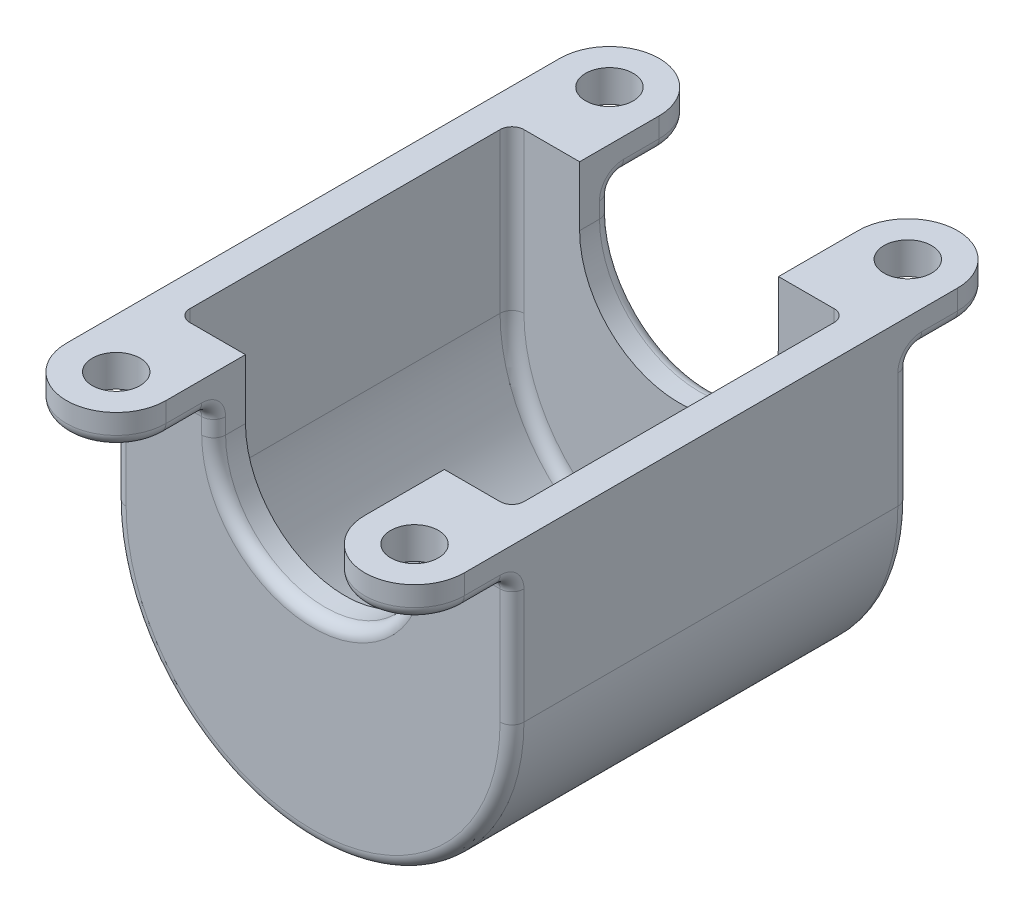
ISO-10303-21;
HEADER;
FILE_DESCRIPTION(('STEP AP214'),'2;1');
FILE_NAME('part.step','',(''),(''),'','','');
FILE_SCHEMA(('AUTOMOTIVE_DESIGN { 1 0 10303 214 1 1 1 1 }'));
ENDSEC;
DATA;
#1=APPLICATION_CONTEXT('core data for automotive mechanical design processes');
#2=APPLICATION_PROTOCOL_DEFINITION('international standard','automotive_design',2000,#1);
#3=PRODUCT_CONTEXT('',#1,'mechanical');
#4=PRODUCT('Part','Part','',(#3));
#5=PRODUCT_RELATED_PRODUCT_CATEGORY('part','',(#4));
#6=PRODUCT_DEFINITION_FORMATION('','',#4);
#7=PRODUCT_DEFINITION_CONTEXT('part definition',#1,'design');
#8=PRODUCT_DEFINITION('design','',#6,#7);
#9=PRODUCT_DEFINITION_SHAPE('','',#8);
#10=(LENGTH_UNIT() NAMED_UNIT(*) SI_UNIT(.MILLI.,.METRE.));
#11=(NAMED_UNIT(*) PLANE_ANGLE_UNIT() SI_UNIT($,.RADIAN.));
#12=(NAMED_UNIT(*) SI_UNIT($,.STERADIAN.) SOLID_ANGLE_UNIT());
#13=UNCERTAINTY_MEASURE_WITH_UNIT(LENGTH_MEASURE(1.E-05),#10,'distance_accuracy_value','');
#14=(GEOMETRIC_REPRESENTATION_CONTEXT(3) GLOBAL_UNCERTAINTY_ASSIGNED_CONTEXT((#13)) GLOBAL_UNIT_ASSIGNED_CONTEXT((#10,
#11,#12)) REPRESENTATION_CONTEXT('',''));
#15=CARTESIAN_POINT('',(0.,0.,0.));
#16=DIRECTION('',(0.,0.,1.));
#17=DIRECTION('',(1.,0.,0.));
#18=AXIS2_PLACEMENT_3D('',#15,#16,#17);
#19=CARTESIAN_POINT('',(0.,-40.,50.));
#20=DIRECTION('',(0.,0.,1.));
#21=DIRECTION('',(1.,0.,0.));
#22=AXIS2_PLACEMENT_3D('',#19,#20,#21);
#23=PLANE('',#22);
#24=CARTESIAN_POINT('',(0.,-15.,50.));
#25=DIRECTION('',(0.,0.,1.));
#26=DIRECTION('',(1.,0.,0.));
#27=AXIS2_PLACEMENT_3D('',#24,#25,#26);
#28=CIRCLE('',#27,28.);
#29=CARTESIAN_POINT('',(28.,-15.,50.));
#30=VERTEX_POINT('',#29);
#31=CARTESIAN_POINT('',(-28.,-15.,50.));
#32=VERTEX_POINT('',#31);
#33=EDGE_CURVE('E562',#30,#32,#28,.F.);
#34=ORIENTED_EDGE('',*,*,#33,.T.);
#35=DIRECTION('',(0.,-1.,0.));
#36=VECTOR('',#35,1.);
#37=CARTESIAN_POINT('',(-28.,-40.,50.));
#38=LINE('',#37,#36);
#39=CARTESIAN_POINT('',(-28.,-11.,50.));
#40=VERTEX_POINT('',#39);
#41=EDGE_CURVE('E565',#32,#40,#38,.F.);
#42=ORIENTED_EDGE('',*,*,#41,.T.);
#43=DIRECTION('',(-1.,0.,0.));
#44=VECTOR('',#43,1.);
#45=CARTESIAN_POINT('',(0.,-11.,50.));
#46=LINE('',#45,#44);
#47=CARTESIAN_POINT('',(-47.,-11.,50.));
#48=VERTEX_POINT('',#47);
#49=EDGE_CURVE('E508',#40,#48,#46,.T.);
#50=ORIENTED_EDGE('',*,*,#49,.T.);
#51=DIRECTION('',(0.,-1.,0.));
#52=VECTOR('',#51,1.);
#53=CARTESIAN_POINT('',(-47.,-40.,50.));
#54=LINE('',#53,#52);
#55=CARTESIAN_POINT('',(-47.,-40.,50.));
#56=VERTEX_POINT('',#55);
#57=EDGE_CURVE('E558',#48,#56,#54,.T.);
#58=ORIENTED_EDGE('',*,*,#57,.T.);
#59=CARTESIAN_POINT('',(0.,-40.,50.));
#60=DIRECTION('',(0.,0.,1.));
#61=DIRECTION('',(1.,0.,0.));
#62=AXIS2_PLACEMENT_3D('',#59,#60,#61);
#63=CIRCLE('',#62,47.);
#64=CARTESIAN_POINT('',(47.,-40.,50.));
#65=VERTEX_POINT('',#64);
#66=EDGE_CURVE('E554',#56,#65,#63,.T.);
#67=ORIENTED_EDGE('',*,*,#66,.T.);
#68=DIRECTION('',(0.,-1.,0.));
#69=VECTOR('',#68,1.);
#70=CARTESIAN_POINT('',(47.,-40.,50.));
#71=LINE('',#70,#69);
#72=CARTESIAN_POINT('',(47.,-11.,50.));
#73=VERTEX_POINT('',#72);
#74=EDGE_CURVE('E556',#65,#73,#71,.F.);
#75=ORIENTED_EDGE('',*,*,#74,.T.);
#76=DIRECTION('',(-1.,0.,0.));
#77=VECTOR('',#76,1.);
#78=CARTESIAN_POINT('',(0.,-11.,50.));
#79=LINE('',#78,#77);
#80=CARTESIAN_POINT('',(28.,-11.,50.));
#81=VERTEX_POINT('',#80);
#82=EDGE_CURVE('E511',#73,#81,#79,.T.);
#83=ORIENTED_EDGE('',*,*,#82,.T.);
#84=DIRECTION('',(0.,-1.,0.));
#85=VECTOR('',#84,1.);
#86=CARTESIAN_POINT('',(28.,-15.,50.));
#87=LINE('',#86,#85);
#88=EDGE_CURVE('E560',#81,#30,#87,.T.);
#89=ORIENTED_EDGE('',*,*,#88,.T.);
#90=EDGE_LOOP('',(#34,#42,#50,#58,#67,#75,#83,#89));
#91=FACE_BOUND('',#90,.T.);
#92=ADVANCED_FACE('F40',(#91),#23,.T.);
#93=CARTESIAN_POINT('',(-25.,0.,50.));
#94=DIRECTION('',(0.,-1.,0.));
#95=DIRECTION('',(1.,0.,0.));
#96=AXIS2_PLACEMENT_3D('',#93,#94,#95);
#97=PLANE('',#96);
#98=DIRECTION('',(-1.,0.,0.));
#99=VECTOR('',#98,1.);
#100=CARTESIAN_POINT('',(-25.,0.,42.));
#101=LINE('',#100,#99);
#102=CARTESIAN_POINT('',(-25.,0.,42.));
#103=VERTEX_POINT('',#102);
#104=CARTESIAN_POINT('',(-39.,0.,42.));
#105=VERTEX_POINT('',#104);
#106=EDGE_CURVE('E439',#103,#105,#101,.T.);
#107=ORIENTED_EDGE('',*,*,#106,.T.);
#108=CARTESIAN_POINT('',(-39.,0.,39.));
#109=DIRECTION('',(0.,-1.,0.));
#110=DIRECTION('',(1.,0.,0.));
#111=AXIS2_PLACEMENT_3D('',#108,#109,#110);
#112=CIRCLE('',#111,3.);
#113=CARTESIAN_POINT('',(-42.,0.,39.));
#114=VERTEX_POINT('',#113);
#115=EDGE_CURVE('E536',#105,#114,#112,.T.);
#116=ORIENTED_EDGE('',*,*,#115,.T.);
#117=DIRECTION('',(0.,0.,-1.));
#118=VECTOR('',#117,1.);
#119=CARTESIAN_POINT('',(-42.,0.,50.));
#120=LINE('',#119,#118);
#121=CARTESIAN_POINT('',(-42.,0.,-39.));
#122=VERTEX_POINT('',#121);
#123=EDGE_CURVE('E443',#114,#122,#120,.T.);
#124=ORIENTED_EDGE('',*,*,#123,.T.);
#125=CARTESIAN_POINT('',(-39.,0.,-39.));
#126=DIRECTION('',(0.,-1.,0.));
#127=DIRECTION('',(1.,0.,0.));
#128=AXIS2_PLACEMENT_3D('',#125,#126,#127);
#129=CIRCLE('',#128,3.);
#130=CARTESIAN_POINT('',(-39.,0.,-42.));
#131=VERTEX_POINT('',#130);
#132=EDGE_CURVE('E532',#122,#131,#129,.T.);
#133=ORIENTED_EDGE('',*,*,#132,.T.);
#134=DIRECTION('',(-1.,0.,0.));
#135=VECTOR('',#134,1.);
#136=CARTESIAN_POINT('',(-25.,0.,-42.));
#137=LINE('',#136,#135);
#138=CARTESIAN_POINT('',(-25.,0.,-42.));
#139=VERTEX_POINT('',#138);
#140=EDGE_CURVE('E392',#139,#131,#137,.T.);
#141=ORIENTED_EDGE('',*,*,#140,.F.);
#142=DIRECTION('',(0.,0.,1.));
#143=VECTOR('',#142,1.);
#144=CARTESIAN_POINT('',(-25.,0.,-50.));
#145=LINE('',#144,#143);
#146=CARTESIAN_POINT('',(-25.,0.,-62.));
#147=VERTEX_POINT('',#146);
#148=EDGE_CURVE('E399',#147,#139,#145,.T.);
#149=ORIENTED_EDGE('',*,*,#148,.F.);
#150=CARTESIAN_POINT('',(-37.5,0.,-62.));
#151=DIRECTION('',(0.,-1.,0.));
#152=DIRECTION('',(-1.,0.,0.));
#153=AXIS2_PLACEMENT_3D('',#150,#151,#152);
#154=CIRCLE('',#153,12.5);
#155=CARTESIAN_POINT('',(-50.,0.,-62.));
#156=VERTEX_POINT('',#155);
#157=EDGE_CURVE('E383',#156,#147,#154,.T.);
#158=ORIENTED_EDGE('',*,*,#157,.F.);
#159=DIRECTION('',(0.,0.,-1.));
#160=VECTOR('',#159,1.);
#161=CARTESIAN_POINT('',(-50.,0.,50.));
#162=LINE('',#161,#160);
#163=CARTESIAN_POINT('',(-50.,0.,62.));
#164=VERTEX_POINT('',#163);
#165=EDGE_CURVE('E479',#164,#156,#162,.T.);
#166=ORIENTED_EDGE('',*,*,#165,.F.);
#167=CARTESIAN_POINT('',(-37.5,0.,62.));
#168=DIRECTION('',(0.,1.,0.));
#169=DIRECTION('',(-1.,0.,0.));
#170=AXIS2_PLACEMENT_3D('',#167,#168,#169);
#171=CIRCLE('',#170,12.5);
#172=CARTESIAN_POINT('',(-25.,0.,62.));
#173=VERTEX_POINT('',#172);
#174=EDGE_CURVE('E430',#164,#173,#171,.T.);
#175=ORIENTED_EDGE('',*,*,#174,.T.);
#176=DIRECTION('',(0.,0.,-1.));
#177=VECTOR('',#176,1.);
#178=CARTESIAN_POINT('',(-25.,0.,50.));
#179=LINE('',#178,#177);
#180=EDGE_CURVE('E450',#173,#103,#179,.T.);
#181=ORIENTED_EDGE('',*,*,#180,.T.);
#182=EDGE_LOOP('',(#107,#116,#124,#133,#141,#149,#158,#166,#175,#181));
#183=FACE_BOUND('',#182,.T.);
#184=CARTESIAN_POINT('',(-37.5,0.,62.));
#185=DIRECTION('',(0.,1.,0.));
#186=DIRECTION('',(-1.,0.,0.));
#187=AXIS2_PLACEMENT_3D('',#184,#185,#186);
#188=CIRCLE('',#187,6.);
#189=CARTESIAN_POINT('',(-43.5,0.,62.));
#190=VERTEX_POINT('',#189);
#191=EDGE_CURVE('E426',#190,#190,#188,.T.);
#192=ORIENTED_EDGE('',*,*,#191,.F.);
#193=EDGE_LOOP('',(#192));
#194=FACE_BOUND('',#193,.T.);
#195=CARTESIAN_POINT('',(-37.5,0.,-62.));
#196=DIRECTION('',(0.,-1.,0.));
#197=DIRECTION('',(-1.,0.,0.));
#198=AXIS2_PLACEMENT_3D('',#195,#196,#197);
#199=CIRCLE('',#198,6.);
#200=CARTESIAN_POINT('',(-43.5,0.,-62.));
#201=VERTEX_POINT('',#200);
#202=EDGE_CURVE('E354',#201,#201,#199,.T.);
#203=ORIENTED_EDGE('',*,*,#202,.T.);
#204=EDGE_LOOP('',(#203));
#205=FACE_BOUND('',#204,.T.);
#206=ADVANCED_FACE('F919',(#183,#194,#205),#97,.F.);
#207=CARTESIAN_POINT('',(-50.,0.,50.));
#208=DIRECTION('',(1.,0.,0.));
#209=DIRECTION('',(0.,1.,0.));
#210=AXIS2_PLACEMENT_3D('',#207,#208,#209);
#211=PLANE('',#210);
#212=CARTESIAN_POINT('',(-50.,-11.,53.));
#213=DIRECTION('',(1.,0.,0.));
#214=DIRECTION('',(0.,1.,0.));
#215=AXIS2_PLACEMENT_3D('',#212,#213,#214);
#216=CIRCLE('',#215,6.);
#217=CARTESIAN_POINT('',(-50.,-11.,47.));
#218=VERTEX_POINT('',#217);
#219=CARTESIAN_POINT('',(-50.,-4.99999999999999,53.));
#220=VERTEX_POINT('',#219);
#221=EDGE_CURVE('E663',#218,#220,#216,.T.);
#222=ORIENTED_EDGE('',*,*,#221,.T.);
#223=DIRECTION('',(0.,0.,-1.));
#224=VECTOR('',#223,1.);
#225=CARTESIAN_POINT('',(-50.,-4.99999999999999,50.));
#226=LINE('',#225,#224);
#227=CARTESIAN_POINT('',(-50.,-4.99999999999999,62.));
#228=VERTEX_POINT('',#227);
#229=EDGE_CURVE('E665',#220,#228,#226,.F.);
#230=ORIENTED_EDGE('',*,*,#229,.T.);
#231=DIRECTION('',(0.,1.,0.));
#232=VECTOR('',#231,1.);
#233=CARTESIAN_POINT('',(-50.,-7.99999999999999,62.));
#234=LINE('',#233,#232);
#235=EDGE_CURVE('E435',#228,#164,#234,.T.);
#236=ORIENTED_EDGE('',*,*,#235,.T.);
#237=ORIENTED_EDGE('',*,*,#165,.T.);
#238=DIRECTION('',(0.,1.,0.));
#239=VECTOR('',#238,1.);
#240=CARTESIAN_POINT('',(-50.,-7.99999999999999,-62.));
#241=LINE('',#240,#239);
#242=CARTESIAN_POINT('',(-50.,-4.99999999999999,-62.));
#243=VERTEX_POINT('',#242);
#244=EDGE_CURVE('E388',#243,#156,#241,.T.);
#245=ORIENTED_EDGE('',*,*,#244,.F.);
#246=DIRECTION('',(0.,0.,1.));
#247=VECTOR('',#246,1.);
#248=CARTESIAN_POINT('',(-50.,-4.99999999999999,50.));
#249=LINE('',#248,#247);
#250=CARTESIAN_POINT('',(-50.,-4.99999999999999,-53.));
#251=VERTEX_POINT('',#250);
#252=EDGE_CURVE('E659',#243,#251,#249,.T.);
#253=ORIENTED_EDGE('',*,*,#252,.T.);
#254=CARTESIAN_POINT('',(-50.,-11.,-53.));
#255=DIRECTION('',(1.,0.,0.));
#256=DIRECTION('',(0.,1.,0.));
#257=AXIS2_PLACEMENT_3D('',#254,#255,#256);
#258=CIRCLE('',#257,6.);
#259=CARTESIAN_POINT('',(-50.,-11.,-47.));
#260=VERTEX_POINT('',#259);
#261=EDGE_CURVE('E657',#251,#260,#258,.T.);
#262=ORIENTED_EDGE('',*,*,#261,.T.);
#263=DIRECTION('',(0.,-1.,0.));
#264=VECTOR('',#263,1.);
#265=CARTESIAN_POINT('',(-50.,-40.,-47.));
#266=LINE('',#265,#264);
#267=CARTESIAN_POINT('',(-50.,-40.,-47.));
#268=VERTEX_POINT('',#267);
#269=EDGE_CURVE('E655',#260,#268,#266,.T.);
#270=ORIENTED_EDGE('',*,*,#269,.T.);
#271=DIRECTION('',(0.,0.,-1.));
#272=VECTOR('',#271,1.);
#273=CARTESIAN_POINT('',(-50.,-40.,50.));
#274=LINE('',#273,#272);
#275=CARTESIAN_POINT('',(-50.,-40.,47.));
#276=VERTEX_POINT('',#275);
#277=EDGE_CURVE('E476',#276,#268,#274,.T.);
#278=ORIENTED_EDGE('',*,*,#277,.F.);
#279=DIRECTION('',(0.,-1.,0.));
#280=VECTOR('',#279,1.);
#281=CARTESIAN_POINT('',(-50.,-11.,47.));
#282=LINE('',#281,#280);
#283=EDGE_CURVE('E661',#276,#218,#282,.F.);
#284=ORIENTED_EDGE('',*,*,#283,.T.);
#285=EDGE_LOOP('',(#222,#230,#236,#237,#245,#253,#262,#270,#278,#284));
#286=FACE_BOUND('',#285,.T.);
#287=ADVANCED_FACE('F823',(#286),#211,.F.);
#288=CARTESIAN_POINT('',(0.,-40.,50.));
#289=DIRECTION('',(0.,0.,-1.));
#290=DIRECTION('',(-1.,0.,0.));
#291=AXIS2_PLACEMENT_3D('',#288,#289,#290);
#292=CYLINDRICAL_SURFACE('',#291,50.);
#293=DIRECTION('',(0.,0.,-1.));
#294=VECTOR('',#293,1.);
#295=CARTESIAN_POINT('',(50.,-40.,50.));
#296=LINE('',#295,#294);
#297=CARTESIAN_POINT('',(50.,-40.,47.));
#298=VERTEX_POINT('',#297);
#299=CARTESIAN_POINT('',(50.,-40.,-47.));
#300=VERTEX_POINT('',#299);
#301=EDGE_CURVE('E366',#298,#300,#296,.T.);
#302=ORIENTED_EDGE('',*,*,#301,.F.);
#303=CARTESIAN_POINT('',(0.,-40.,47.));
#304=DIRECTION('',(0.,0.,1.));
#305=DIRECTION('',(1.,0.,0.));
#306=AXIS2_PLACEMENT_3D('',#303,#304,#305);
#307=CIRCLE('',#306,50.);
#308=EDGE_CURVE('E11',#298,#276,#307,.F.);
#309=ORIENTED_EDGE('',*,*,#308,.T.);
#310=ORIENTED_EDGE('',*,*,#277,.T.);
#311=CARTESIAN_POINT('',(0.,-40.,-47.));
#312=DIRECTION('',(0.,0.,-1.));
#313=DIRECTION('',(-1.,0.,0.));
#314=AXIS2_PLACEMENT_3D('',#311,#312,#313);
#315=CIRCLE('',#314,50.);
#316=EDGE_CURVE('E49',#268,#300,#315,.F.);
#317=ORIENTED_EDGE('',*,*,#316,.T.);
#318=EDGE_LOOP('',(#302,#309,#310,#317));
#319=FACE_BOUND('',#318,.T.);
#320=ADVANCED_FACE('F779',(#319),#292,.T.);
#321=CARTESIAN_POINT('',(50.,0.,50.));
#322=DIRECTION('',(1.,0.,0.));
#323=DIRECTION('',(0.,1.,0.));
#324=AXIS2_PLACEMENT_3D('',#321,#322,#323);
#325=PLANE('',#324);
#326=DIRECTION('',(0.,1.,0.));
#327=VECTOR('',#326,1.);
#328=CARTESIAN_POINT('',(50.,-7.99999999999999,62.));
#329=LINE('',#328,#327);
#330=CARTESIAN_POINT('',(50.,-4.99999999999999,62.));
#331=VERTEX_POINT('',#330);
#332=CARTESIAN_POINT('',(50.,0.,62.));
#333=VERTEX_POINT('',#332);
#334=EDGE_CURVE('E424',#331,#333,#329,.T.);
#335=ORIENTED_EDGE('',*,*,#334,.F.);
#336=DIRECTION('',(0.,0.,-1.));
#337=VECTOR('',#336,1.);
#338=CARTESIAN_POINT('',(50.,-4.99999999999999,53.));
#339=LINE('',#338,#337);
#340=CARTESIAN_POINT('',(50.,-4.99999999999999,53.));
#341=VERTEX_POINT('',#340);
#342=EDGE_CURVE('E57',#331,#341,#339,.T.);
#343=ORIENTED_EDGE('',*,*,#342,.T.);
#344=CARTESIAN_POINT('',(50.,-11.,53.));
#345=DIRECTION('',(1.,0.,0.));
#346=DIRECTION('',(0.,1.,0.));
#347=AXIS2_PLACEMENT_3D('',#344,#345,#346);
#348=CIRCLE('',#347,6.);
#349=CARTESIAN_POINT('',(50.,-11.,47.));
#350=VERTEX_POINT('',#349);
#351=EDGE_CURVE('E61',#341,#350,#348,.F.);
#352=ORIENTED_EDGE('',*,*,#351,.T.);
#353=DIRECTION('',(0.,-1.,0.));
#354=VECTOR('',#353,1.);
#355=CARTESIAN_POINT('',(50.,0.,47.));
#356=LINE('',#355,#354);
#357=EDGE_CURVE('E672',#350,#298,#356,.T.);
#358=ORIENTED_EDGE('',*,*,#357,.T.);
#359=ORIENTED_EDGE('',*,*,#301,.T.);
#360=DIRECTION('',(0.,-1.,0.));
#361=VECTOR('',#360,1.);
#362=CARTESIAN_POINT('',(50.,0.,-47.));
#363=LINE('',#362,#361);
#364=CARTESIAN_POINT('',(50.,-11.,-47.));
#365=VERTEX_POINT('',#364);
#366=EDGE_CURVE('E667',#300,#365,#363,.F.);
#367=ORIENTED_EDGE('',*,*,#366,.T.);
#368=CARTESIAN_POINT('',(50.,-11.,-53.));
#369=DIRECTION('',(1.,0.,0.));
#370=DIRECTION('',(0.,1.,0.));
#371=AXIS2_PLACEMENT_3D('',#368,#369,#370);
#372=CIRCLE('',#371,6.);
#373=CARTESIAN_POINT('',(50.,-4.99999999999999,-53.));
#374=VERTEX_POINT('',#373);
#375=EDGE_CURVE('E669',#365,#374,#372,.F.);
#376=ORIENTED_EDGE('',*,*,#375,.T.);
#377=DIRECTION('',(0.,0.,1.));
#378=VECTOR('',#377,1.);
#379=CARTESIAN_POINT('',(50.,-4.99999999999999,-62.));
#380=LINE('',#379,#378);
#381=CARTESIAN_POINT('',(50.,-4.99999999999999,-62.));
#382=VERTEX_POINT('',#381);
#383=EDGE_CURVE('E350',#374,#382,#380,.F.);
#384=ORIENTED_EDGE('',*,*,#383,.T.);
#385=DIRECTION('',(0.,1.,0.));
#386=VECTOR('',#385,1.);
#387=CARTESIAN_POINT('',(50.,-7.99999999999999,-62.));
#388=LINE('',#387,#386);
#389=CARTESIAN_POINT('',(50.,0.,-62.));
#390=VERTEX_POINT('',#389);
#391=EDGE_CURVE('E344',#382,#390,#388,.T.);
#392=ORIENTED_EDGE('',*,*,#391,.T.);
#393=DIRECTION('',(0.,0.,-1.));
#394=VECTOR('',#393,1.);
#395=CARTESIAN_POINT('',(50.,0.,50.));
#396=LINE('',#395,#394);
#397=EDGE_CURVE('E347',#333,#390,#396,.T.);
#398=ORIENTED_EDGE('',*,*,#397,.F.);
#399=EDGE_LOOP('',(#335,#343,#352,#358,#359,#367,#376,#384,#392,#398));
#400=FACE_BOUND('',#399,.T.);
#401=ADVANCED_FACE('F346',(#400),#325,.T.);
#402=CARTESIAN_POINT('',(50.,0.,50.));
#403=DIRECTION('',(0.,-1.,0.));
#404=DIRECTION('',(1.,0.,0.));
#405=AXIS2_PLACEMENT_3D('',#402,#403,#404);
#406=PLANE('',#405);
#407=ORIENTED_EDGE('',*,*,#397,.T.);
#408=CARTESIAN_POINT('',(37.5,0.,-62.));
#409=DIRECTION('',(0.,1.,0.));
#410=DIRECTION('',(1.,0.,0.));
#411=AXIS2_PLACEMENT_3D('',#408,#409,#410);
#412=CIRCLE('',#411,12.5);
#413=CARTESIAN_POINT('',(25.,0.,-62.));
#414=VERTEX_POINT('',#413);
#415=EDGE_CURVE('E362',#390,#414,#412,.T.);
#416=ORIENTED_EDGE('',*,*,#415,.T.);
#417=DIRECTION('',(0.,0.,1.));
#418=VECTOR('',#417,1.);
#419=CARTESIAN_POINT('',(25.,0.,-50.));
#420=LINE('',#419,#418);
#421=CARTESIAN_POINT('',(25.,0.,-42.));
#422=VERTEX_POINT('',#421);
#423=EDGE_CURVE('E413',#414,#422,#420,.T.);
#424=ORIENTED_EDGE('',*,*,#423,.T.);
#425=DIRECTION('',(-1.,0.,0.));
#426=VECTOR('',#425,1.);
#427=CARTESIAN_POINT('',(50.,0.,-42.));
#428=LINE('',#427,#426);
#429=CARTESIAN_POINT('',(39.,0.,-42.));
#430=VERTEX_POINT('',#429);
#431=EDGE_CURVE('E395',#430,#422,#428,.T.);
#432=ORIENTED_EDGE('',*,*,#431,.F.);
#433=CARTESIAN_POINT('',(39.,0.,-39.));
#434=DIRECTION('',(0.,-1.,0.));
#435=DIRECTION('',(1.,0.,0.));
#436=AXIS2_PLACEMENT_3D('',#433,#434,#435);
#437=CIRCLE('',#436,3.);
#438=CARTESIAN_POINT('',(42.,0.,-39.));
#439=VERTEX_POINT('',#438);
#440=EDGE_CURVE('E534',#430,#439,#437,.T.);
#441=ORIENTED_EDGE('',*,*,#440,.T.);
#442=DIRECTION('',(0.,0.,-1.));
#443=VECTOR('',#442,1.);
#444=CARTESIAN_POINT('',(42.,0.,50.));
#445=LINE('',#444,#443);
#446=CARTESIAN_POINT('',(42.,0.,39.));
#447=VERTEX_POINT('',#446);
#448=EDGE_CURVE('E447',#447,#439,#445,.T.);
#449=ORIENTED_EDGE('',*,*,#448,.F.);
#450=CARTESIAN_POINT('',(39.,0.,39.));
#451=DIRECTION('',(0.,-1.,0.));
#452=DIRECTION('',(1.,0.,0.));
#453=AXIS2_PLACEMENT_3D('',#450,#451,#452);
#454=CIRCLE('',#453,3.);
#455=CARTESIAN_POINT('',(39.,0.,42.));
#456=VERTEX_POINT('',#455);
#457=EDGE_CURVE('E538',#447,#456,#454,.T.);
#458=ORIENTED_EDGE('',*,*,#457,.T.);
#459=DIRECTION('',(-1.,0.,0.));
#460=VECTOR('',#459,1.);
#461=CARTESIAN_POINT('',(50.,0.,42.));
#462=LINE('',#461,#460);
#463=CARTESIAN_POINT('',(25.,0.,42.));
#464=VERTEX_POINT('',#463);
#465=EDGE_CURVE('E453',#456,#464,#462,.T.);
#466=ORIENTED_EDGE('',*,*,#465,.T.);
#467=DIRECTION('',(0.,0.,-1.));
#468=VECTOR('',#467,1.);
#469=CARTESIAN_POINT('',(25.,0.,50.));
#470=LINE('',#469,#468);
#471=CARTESIAN_POINT('',(25.,0.,62.));
#472=VERTEX_POINT('',#471);
#473=EDGE_CURVE('E367',#472,#464,#470,.T.);
#474=ORIENTED_EDGE('',*,*,#473,.F.);
#475=CARTESIAN_POINT('',(37.5,0.,62.));
#476=DIRECTION('',(0.,-1.,0.));
#477=DIRECTION('',(1.,0.,0.));
#478=AXIS2_PLACEMENT_3D('',#475,#476,#477);
#479=CIRCLE('',#478,12.5);
#480=EDGE_CURVE('E365',#333,#472,#479,.T.);
#481=ORIENTED_EDGE('',*,*,#480,.F.);
#482=EDGE_LOOP('',(#407,#416,#424,#432,#441,#449,#458,#466,#474,#481));
#483=FACE_BOUND('',#482,.T.);
#484=CARTESIAN_POINT('',(37.5,0.,62.));
#485=DIRECTION('',(0.,-1.,0.));
#486=DIRECTION('',(1.,0.,0.));
#487=AXIS2_PLACEMENT_3D('',#484,#485,#486);
#488=CIRCLE('',#487,6.);
#489=CARTESIAN_POINT('',(43.5,0.,62.));
#490=VERTEX_POINT('',#489);
#491=EDGE_CURVE('E415',#490,#490,#488,.T.);
#492=ORIENTED_EDGE('',*,*,#491,.T.);
#493=EDGE_LOOP('',(#492));
#494=FACE_BOUND('',#493,.T.);
#495=CARTESIAN_POINT('',(37.5,0.,-62.));
#496=DIRECTION('',(0.,1.,0.));
#497=DIRECTION('',(1.,0.,0.));
#498=AXIS2_PLACEMENT_3D('',#495,#496,#497);
#499=CIRCLE('',#498,6.);
#500=CARTESIAN_POINT('',(43.5,0.,-62.));
#501=VERTEX_POINT('',#500);
#502=EDGE_CURVE('E376',#501,#501,#499,.T.);
#503=ORIENTED_EDGE('',*,*,#502,.F.);
#504=EDGE_LOOP('',(#503));
#505=FACE_BOUND('',#504,.T.);
#506=ADVANCED_FACE('F359',(#483,#494,#505),#406,.F.);
#507=CARTESIAN_POINT('',(25.,0.,50.));
#508=DIRECTION('',(1.,0.,0.));
#509=DIRECTION('',(0.,1.,0.));
#510=AXIS2_PLACEMENT_3D('',#507,#508,#509);
#511=PLANE('',#510);
#512=DIRECTION('',(0.,0.,-1.));
#513=VECTOR('',#512,1.);
#514=CARTESIAN_POINT('',(25.,-15.,50.));
#515=LINE('',#514,#513);
#516=CARTESIAN_POINT('',(25.,-15.,47.));
#517=VERTEX_POINT('',#516);
#518=CARTESIAN_POINT('',(25.,-15.,42.));
#519=VERTEX_POINT('',#518);
#520=EDGE_CURVE('E470',#517,#519,#515,.T.);
#521=ORIENTED_EDGE('',*,*,#520,.F.);
#522=DIRECTION('',(0.,-1.,0.));
#523=VECTOR('',#522,1.);
#524=CARTESIAN_POINT('',(25.,-11.,47.));
#525=LINE('',#524,#523);
#526=CARTESIAN_POINT('',(25.,-11.,47.));
#527=VERTEX_POINT('',#526);
#528=EDGE_CURVE('E593',#517,#527,#525,.F.);
#529=ORIENTED_EDGE('',*,*,#528,.T.);
#530=CARTESIAN_POINT('',(25.,-11.,53.));
#531=DIRECTION('',(1.,0.,0.));
#532=DIRECTION('',(0.,1.,0.));
#533=AXIS2_PLACEMENT_3D('',#530,#531,#532);
#534=CIRCLE('',#533,6.);
#535=CARTESIAN_POINT('',(25.,-4.99999999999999,53.));
#536=VERTEX_POINT('',#535);
#537=EDGE_CURVE('E591',#527,#536,#534,.T.);
#538=ORIENTED_EDGE('',*,*,#537,.T.);
#539=DIRECTION('',(0.,0.,1.));
#540=VECTOR('',#539,1.);
#541=CARTESIAN_POINT('',(25.,-4.99999999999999,50.));
#542=LINE('',#541,#540);
#543=CARTESIAN_POINT('',(25.,-5.,62.));
#544=VERTEX_POINT('',#543);
#545=EDGE_CURVE('E589',#536,#544,#542,.T.);
#546=ORIENTED_EDGE('',*,*,#545,.T.);
#547=DIRECTION('',(0.,1.,0.));
#548=VECTOR('',#547,1.);
#549=CARTESIAN_POINT('',(25.,-8.,62.));
#550=LINE('',#549,#548);
#551=EDGE_CURVE('E422',#544,#472,#550,.T.);
#552=ORIENTED_EDGE('',*,*,#551,.T.);
#553=ORIENTED_EDGE('',*,*,#473,.T.);
#554=DIRECTION('',(0.,-1.,0.));
#555=VECTOR('',#554,1.);
#556=CARTESIAN_POINT('',(25.,0.,42.));
#557=LINE('',#556,#555);
#558=EDGE_CURVE('E460',#464,#519,#557,.T.);
#559=ORIENTED_EDGE('',*,*,#558,.T.);
#560=EDGE_LOOP('',(#521,#529,#538,#546,#552,#553,#559));
#561=FACE_BOUND('',#560,.T.);
#562=ADVANCED_FACE('F937',(#561),#511,.F.);
#563=CARTESIAN_POINT('',(0.,-15.,50.));
#564=DIRECTION('',(0.,0.,-1.));
#565=DIRECTION('',(-1.,0.,0.));
#566=AXIS2_PLACEMENT_3D('',#563,#564,#565);
#567=CYLINDRICAL_SURFACE('',#566,25.);
#568=DIRECTION('',(0.,0.,-1.));
#569=VECTOR('',#568,1.);
#570=CARTESIAN_POINT('',(-25.,-15.,50.));
#571=LINE('',#570,#569);
#572=CARTESIAN_POINT('',(-25.,-15.,47.));
#573=VERTEX_POINT('',#572);
#574=CARTESIAN_POINT('',(-25.,-15.,42.));
#575=VERTEX_POINT('',#574);
#576=EDGE_CURVE('E468',#573,#575,#571,.T.);
#577=ORIENTED_EDGE('',*,*,#576,.F.);
#578=CARTESIAN_POINT('',(0.,-15.,47.));
#579=DIRECTION('',(0.,0.,1.));
#580=DIRECTION('',(1.,0.,0.));
#581=AXIS2_PLACEMENT_3D('',#578,#579,#580);
#582=CIRCLE('',#581,25.);
#583=EDGE_CURVE('E540',#573,#517,#582,.T.);
#584=ORIENTED_EDGE('',*,*,#583,.T.);
#585=ORIENTED_EDGE('',*,*,#520,.T.);
#586=CARTESIAN_POINT('',(0.,-15.,42.));
#587=DIRECTION('',(0.,0.,1.));
#588=DIRECTION('',(1.,0.,0.));
#589=AXIS2_PLACEMENT_3D('',#586,#587,#588);
#590=CIRCLE('',#589,25.);
#591=EDGE_CURVE('E457',#575,#519,#590,.T.);
#592=ORIENTED_EDGE('',*,*,#591,.F.);
#593=EDGE_LOOP('',(#577,#584,#585,#592));
#594=FACE_BOUND('',#593,.T.);
#595=ADVANCED_FACE('F932',(#594),#567,.F.);
#596=CARTESIAN_POINT('',(-25.,0.,50.));
#597=DIRECTION('',(1.,0.,0.));
#598=DIRECTION('',(0.,1.,0.));
#599=AXIS2_PLACEMENT_3D('',#596,#597,#598);
#600=PLANE('',#599);
#601=CARTESIAN_POINT('',(-25.,-11.,53.));
#602=DIRECTION('',(1.,0.,0.));
#603=DIRECTION('',(0.,1.,0.));
#604=AXIS2_PLACEMENT_3D('',#601,#602,#603);
#605=CIRCLE('',#604,6.);
#606=CARTESIAN_POINT('',(-25.,-4.99999999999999,53.));
#607=VERTEX_POINT('',#606);
#608=CARTESIAN_POINT('',(-25.,-11.,47.));
#609=VERTEX_POINT('',#608);
#610=EDGE_CURVE('E585',#607,#609,#605,.F.);
#611=ORIENTED_EDGE('',*,*,#610,.T.);
#612=DIRECTION('',(0.,-1.,0.));
#613=VECTOR('',#612,1.);
#614=CARTESIAN_POINT('',(-25.,0.,47.));
#615=LINE('',#614,#613);
#616=EDGE_CURVE('E587',#609,#573,#615,.T.);
#617=ORIENTED_EDGE('',*,*,#616,.T.);
#618=ORIENTED_EDGE('',*,*,#576,.T.);
#619=DIRECTION('',(0.,-1.,0.));
#620=VECTOR('',#619,1.);
#621=CARTESIAN_POINT('',(-25.,0.,42.));
#622=LINE('',#621,#620);
#623=EDGE_CURVE('E454',#103,#575,#622,.T.);
#624=ORIENTED_EDGE('',*,*,#623,.F.);
#625=ORIENTED_EDGE('',*,*,#180,.F.);
#626=DIRECTION('',(0.,1.,0.));
#627=VECTOR('',#626,1.);
#628=CARTESIAN_POINT('',(-25.,-8.,62.));
#629=LINE('',#628,#627);
#630=CARTESIAN_POINT('',(-25.,-5.,62.));
#631=VERTEX_POINT('',#630);
#632=EDGE_CURVE('E437',#631,#173,#629,.T.);
#633=ORIENTED_EDGE('',*,*,#632,.F.);
#634=DIRECTION('',(0.,0.,1.));
#635=VECTOR('',#634,1.);
#636=CARTESIAN_POINT('',(-25.,-4.99999999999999,53.));
#637=LINE('',#636,#635);
#638=EDGE_CURVE('E583',#631,#607,#637,.F.);
#639=ORIENTED_EDGE('',*,*,#638,.T.);
#640=EDGE_LOOP('',(#611,#617,#618,#624,#625,#633,#639));
#641=FACE_BOUND('',#640,.T.);
#642=ADVANCED_FACE('F926',(#641),#600,.T.);
#643=CARTESIAN_POINT('',(-42.,0.,50.));
#644=DIRECTION('',(1.,0.,0.));
#645=DIRECTION('',(0.,1.,0.));
#646=AXIS2_PLACEMENT_3D('',#643,#644,#645);
#647=PLANE('',#646);
#648=DIRECTION('',(0.,0.,-1.));
#649=VECTOR('',#648,1.);
#650=CARTESIAN_POINT('',(-42.,-40.,50.));
#651=LINE('',#650,#649);
#652=CARTESIAN_POINT('',(-42.,-40.,39.));
#653=VERTEX_POINT('',#652);
#654=CARTESIAN_POINT('',(-42.,-40.,-39.));
#655=VERTEX_POINT('',#654);
#656=EDGE_CURVE('E440',#653,#655,#651,.T.);
#657=ORIENTED_EDGE('',*,*,#656,.T.);
#658=DIRECTION('',(0.,-1.,0.));
#659=VECTOR('',#658,1.);
#660=CARTESIAN_POINT('',(-42.,0.,-39.));
#661=LINE('',#660,#659);
#662=EDGE_CURVE('E492',#655,#122,#661,.F.);
#663=ORIENTED_EDGE('',*,*,#662,.T.);
#664=ORIENTED_EDGE('',*,*,#123,.F.);
#665=DIRECTION('',(0.,-1.,0.));
#666=VECTOR('',#665,1.);
#667=CARTESIAN_POINT('',(-42.,0.,39.));
#668=LINE('',#667,#666);
#669=EDGE_CURVE('E489',#114,#653,#668,.T.);
#670=ORIENTED_EDGE('',*,*,#669,.T.);
#671=EDGE_LOOP('',(#657,#663,#664,#670));
#672=FACE_BOUND('',#671,.T.);
#673=ADVANCED_FACE('F909',(#672),#647,.T.);
#674=CARTESIAN_POINT('',(0.,-40.,50.));
#675=DIRECTION('',(0.,0.,-1.));
#676=DIRECTION('',(-1.,0.,0.));
#677=AXIS2_PLACEMENT_3D('',#674,#675,#676);
#678=CYLINDRICAL_SURFACE('',#677,42.);
#679=DIRECTION('',(0.,0.,1.));
#680=VECTOR('',#679,1.);
#681=CARTESIAN_POINT('',(42.,-40.,50.));
#682=LINE('',#681,#680);
#683=CARTESIAN_POINT('',(42.,-40.,39.));
#684=VERTEX_POINT('',#683);
#685=CARTESIAN_POINT('',(42.,-40.,-39.));
#686=VERTEX_POINT('',#685);
#687=EDGE_CURVE('E444',#684,#686,#682,.F.);
#688=ORIENTED_EDGE('',*,*,#687,.T.);
#689=CARTESIAN_POINT('',(0.,-40.,-39.));
#690=DIRECTION('',(0.,0.,-1.));
#691=DIRECTION('',(-1.,0.,0.));
#692=AXIS2_PLACEMENT_3D('',#689,#690,#691);
#693=CIRCLE('',#692,42.);
#694=EDGE_CURVE('E506',#686,#655,#693,.T.);
#695=ORIENTED_EDGE('',*,*,#694,.T.);
#696=ORIENTED_EDGE('',*,*,#656,.F.);
#697=CARTESIAN_POINT('',(0.,-40.,39.));
#698=DIRECTION('',(0.,0.,1.));
#699=DIRECTION('',(1.,0.,0.));
#700=AXIS2_PLACEMENT_3D('',#697,#698,#699);
#701=CIRCLE('',#700,42.);
#702=EDGE_CURVE('E504',#653,#684,#701,.T.);
#703=ORIENTED_EDGE('',*,*,#702,.T.);
#704=EDGE_LOOP('',(#688,#695,#696,#703));
#705=FACE_BOUND('',#704,.T.);
#706=ADVANCED_FACE('F898',(#705),#678,.F.);
#707=CARTESIAN_POINT('',(42.,0.,50.));
#708=DIRECTION('',(1.,0.,0.));
#709=DIRECTION('',(0.,1.,0.));
#710=AXIS2_PLACEMENT_3D('',#707,#708,#709);
#711=PLANE('',#710);
#712=ORIENTED_EDGE('',*,*,#448,.T.);
#713=DIRECTION('',(0.,-1.,0.));
#714=VECTOR('',#713,1.);
#715=CARTESIAN_POINT('',(42.,-40.,-39.));
#716=LINE('',#715,#714);
#717=EDGE_CURVE('E496',#439,#686,#716,.T.);
#718=ORIENTED_EDGE('',*,*,#717,.T.);
#719=ORIENTED_EDGE('',*,*,#687,.F.);
#720=DIRECTION('',(0.,-1.,0.));
#721=VECTOR('',#720,1.);
#722=CARTESIAN_POINT('',(42.,0.,39.));
#723=LINE('',#722,#721);
#724=EDGE_CURVE('E494',#684,#447,#723,.F.);
#725=ORIENTED_EDGE('',*,*,#724,.T.);
#726=EDGE_LOOP('',(#712,#718,#719,#725));
#727=FACE_BOUND('',#726,.T.);
#728=ADVANCED_FACE('F895',(#727),#711,.F.);
#729=CARTESIAN_POINT('',(0.,-40.,42.));
#730=DIRECTION('',(0.,0.,1.));
#731=DIRECTION('',(1.,0.,0.));
#732=AXIS2_PLACEMENT_3D('',#729,#730,#731);
#733=PLANE('',#732);
#734=CARTESIAN_POINT('',(0.,-40.,42.));
#735=DIRECTION('',(0.,0.,1.));
#736=DIRECTION('',(1.,0.,0.));
#737=AXIS2_PLACEMENT_3D('',#734,#735,#736);
#738=CIRCLE('',#737,39.);
#739=CARTESIAN_POINT('',(39.,-40.,42.));
#740=VERTEX_POINT('',#739);
#741=CARTESIAN_POINT('',(-39.,-40.,42.));
#742=VERTEX_POINT('',#741);
#743=EDGE_CURVE('E498',#740,#742,#738,.F.);
#744=ORIENTED_EDGE('',*,*,#743,.T.);
#745=DIRECTION('',(0.,-1.,0.));
#746=VECTOR('',#745,1.);
#747=CARTESIAN_POINT('',(-39.,-40.,42.));
#748=LINE('',#747,#746);
#749=EDGE_CURVE('E502',#742,#105,#748,.F.);
#750=ORIENTED_EDGE('',*,*,#749,.T.);
#751=ORIENTED_EDGE('',*,*,#106,.F.);
#752=ORIENTED_EDGE('',*,*,#623,.T.);
#753=ORIENTED_EDGE('',*,*,#591,.T.);
#754=ORIENTED_EDGE('',*,*,#558,.F.);
#755=ORIENTED_EDGE('',*,*,#465,.F.);
#756=DIRECTION('',(0.,-1.,0.));
#757=VECTOR('',#756,1.);
#758=CARTESIAN_POINT('',(39.,-40.,42.));
#759=LINE('',#758,#757);
#760=EDGE_CURVE('E500',#456,#740,#759,.T.);
#761=ORIENTED_EDGE('',*,*,#760,.T.);
#762=EDGE_LOOP('',(#744,#750,#751,#752,#753,#754,#755,#761));
#763=FACE_BOUND('',#762,.T.);
#764=ADVANCED_FACE('F916',(#763),#733,.F.);
#765=CARTESIAN_POINT('',(-37.5,-7.99999999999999,62.));
#766=DIRECTION('',(0.,1.,0.));
#767=DIRECTION('',(-1.,0.,0.));
#768=AXIS2_PLACEMENT_3D('',#765,#766,#767);
#769=CYLINDRICAL_SURFACE('',#768,12.5);
#770=ORIENTED_EDGE('',*,*,#235,.F.);
#771=CARTESIAN_POINT('',(-37.5,-4.99999999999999,62.));
#772=DIRECTION('',(0.,1.,0.));
#773=DIRECTION('',(-1.,0.,0.));
#774=AXIS2_PLACEMENT_3D('',#771,#772,#773);
#775=CIRCLE('',#774,12.5);
#776=EDGE_CURVE('E647',#228,#631,#775,.T.);
#777=ORIENTED_EDGE('',*,*,#776,.T.);
#778=ORIENTED_EDGE('',*,*,#632,.T.);
#779=ORIENTED_EDGE('',*,*,#174,.F.);
#780=EDGE_LOOP('',(#770,#777,#778,#779));
#781=FACE_BOUND('',#780,.T.);
#782=ADVANCED_FACE('F1365',(#781),#769,.T.);
#783=CARTESIAN_POINT('',(-37.5,-7.99999999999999,62.));
#784=DIRECTION('',(0.,1.,0.));
#785=DIRECTION('',(-1.,0.,0.));
#786=AXIS2_PLACEMENT_3D('',#783,#784,#785);
#787=PLANE('',#786);
#788=DIRECTION('',(-1.,0.,0.));
#789=VECTOR('',#788,1.);
#790=CARTESIAN_POINT('',(-37.5,-7.99999999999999,53.));
#791=LINE('',#790,#789);
#792=CARTESIAN_POINT('',(-47.,-7.99999999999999,53.));
#793=VERTEX_POINT('',#792);
#794=CARTESIAN_POINT('',(-28.,-8.,53.));
#795=VERTEX_POINT('',#794);
#796=EDGE_CURVE('E517',#793,#795,#791,.F.);
#797=ORIENTED_EDGE('',*,*,#796,.T.);
#798=DIRECTION('',(0.,0.,1.));
#799=VECTOR('',#798,1.);
#800=CARTESIAN_POINT('',(-28.,-8.,62.));
#801=LINE('',#800,#799);
#802=CARTESIAN_POINT('',(-28.,-8.,62.));
#803=VERTEX_POINT('',#802);
#804=EDGE_CURVE('E627',#795,#803,#801,.T.);
#805=ORIENTED_EDGE('',*,*,#804,.T.);
#806=CARTESIAN_POINT('',(-37.5,-7.99999999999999,62.));
#807=DIRECTION('',(0.,1.,0.));
#808=DIRECTION('',(-1.,0.,0.));
#809=AXIS2_PLACEMENT_3D('',#806,#807,#808);
#810=CIRCLE('',#809,9.50000000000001);
#811=CARTESIAN_POINT('',(-47.,-7.99999999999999,62.));
#812=VERTEX_POINT('',#811);
#813=EDGE_CURVE('E625',#803,#812,#810,.F.);
#814=ORIENTED_EDGE('',*,*,#813,.T.);
#815=DIRECTION('',(0.,0.,-1.));
#816=VECTOR('',#815,1.);
#817=CARTESIAN_POINT('',(-47.,-7.99999999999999,62.));
#818=LINE('',#817,#816);
#819=EDGE_CURVE('E623',#812,#793,#818,.T.);
#820=ORIENTED_EDGE('',*,*,#819,.T.);
#821=EDGE_LOOP('',(#797,#805,#814,#820));
#822=FACE_BOUND('',#821,.T.);
#823=CARTESIAN_POINT('',(-37.5,-7.99999999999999,62.));
#824=DIRECTION('',(0.,1.,0.));
#825=DIRECTION('',(-1.,0.,0.));
#826=AXIS2_PLACEMENT_3D('',#823,#824,#825);
#827=CIRCLE('',#826,6.);
#828=CARTESIAN_POINT('',(-43.5,-7.99999999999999,62.));
#829=VERTEX_POINT('',#828);
#830=EDGE_CURVE('E427',#829,#829,#827,.T.);
#831=ORIENTED_EDGE('',*,*,#830,.T.);
#832=EDGE_LOOP('',(#831));
#833=FACE_BOUND('',#832,.T.);
#834=ADVANCED_FACE('F1354',(#822,#833),#787,.F.);
#835=CARTESIAN_POINT('',(-37.5,-7.99999999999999,62.));
#836=DIRECTION('',(0.,1.,0.));
#837=DIRECTION('',(-1.,0.,0.));
#838=AXIS2_PLACEMENT_3D('',#835,#836,#837);
#839=CYLINDRICAL_SURFACE('',#838,6.);
#840=ORIENTED_EDGE('',*,*,#830,.F.);
#841=EDGE_LOOP('',(#840));
#842=FACE_BOUND('',#841,.T.);
#843=ORIENTED_EDGE('',*,*,#191,.T.);
#844=EDGE_LOOP('',(#843));
#845=FACE_BOUND('',#844,.T.);
#846=ADVANCED_FACE('F1345',(#842,#845),#839,.F.);
#847=CARTESIAN_POINT('',(37.5,-7.99999999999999,62.));
#848=DIRECTION('',(0.,1.,0.));
#849=DIRECTION('',(1.,0.,0.));
#850=AXIS2_PLACEMENT_3D('',#847,#848,#849);
#851=PLANE('',#850);
#852=CARTESIAN_POINT('',(37.5,-7.99999999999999,62.));
#853=DIRECTION('',(0.,1.,0.));
#854=DIRECTION('',(-1.,0.,0.));
#855=AXIS2_PLACEMENT_3D('',#852,#853,#854);
#856=CIRCLE('',#855,9.50000000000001);
#857=CARTESIAN_POINT('',(47.,-7.99999999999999,62.));
#858=VERTEX_POINT('',#857);
#859=CARTESIAN_POINT('',(28.,-8.,62.));
#860=VERTEX_POINT('',#859);
#861=EDGE_CURVE('E631',#858,#860,#856,.F.);
#862=ORIENTED_EDGE('',*,*,#861,.T.);
#863=DIRECTION('',(0.,0.,1.));
#864=VECTOR('',#863,1.);
#865=CARTESIAN_POINT('',(28.,-8.,62.));
#866=LINE('',#865,#864);
#867=CARTESIAN_POINT('',(28.,-8.,53.));
#868=VERTEX_POINT('',#867);
#869=EDGE_CURVE('E633',#860,#868,#866,.F.);
#870=ORIENTED_EDGE('',*,*,#869,.T.);
#871=DIRECTION('',(-1.,0.,0.));
#872=VECTOR('',#871,1.);
#873=CARTESIAN_POINT('',(37.5,-7.99999999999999,53.));
#874=LINE('',#873,#872);
#875=CARTESIAN_POINT('',(47.,-7.99999999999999,53.));
#876=VERTEX_POINT('',#875);
#877=EDGE_CURVE('E514',#868,#876,#874,.F.);
#878=ORIENTED_EDGE('',*,*,#877,.T.);
#879=DIRECTION('',(0.,0.,-1.));
#880=VECTOR('',#879,1.);
#881=CARTESIAN_POINT('',(47.,-7.99999999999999,62.));
#882=LINE('',#881,#880);
#883=EDGE_CURVE('E629',#876,#858,#882,.F.);
#884=ORIENTED_EDGE('',*,*,#883,.T.);
#885=EDGE_LOOP('',(#862,#870,#878,#884));
#886=FACE_BOUND('',#885,.T.);
#887=CARTESIAN_POINT('',(37.5,-7.99999999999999,62.));
#888=DIRECTION('',(0.,-1.,0.));
#889=DIRECTION('',(1.,0.,0.));
#890=AXIS2_PLACEMENT_3D('',#887,#888,#889);
#891=CIRCLE('',#890,6.);
#892=CARTESIAN_POINT('',(43.5,-7.99999999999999,62.));
#893=VERTEX_POINT('',#892);
#894=EDGE_CURVE('E416',#893,#893,#891,.T.);
#895=ORIENTED_EDGE('',*,*,#894,.F.);
#896=EDGE_LOOP('',(#895));
#897=FACE_BOUND('',#896,.T.);
#898=ADVANCED_FACE('F799',(#886,#897),#851,.F.);
#899=CARTESIAN_POINT('',(37.5,-7.99999999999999,62.));
#900=DIRECTION('',(0.,1.,0.));
#901=DIRECTION('',(-1.,0.,0.));
#902=AXIS2_PLACEMENT_3D('',#899,#900,#901);
#903=CYLINDRICAL_SURFACE('',#902,12.5);
#904=ORIENTED_EDGE('',*,*,#551,.F.);
#905=CARTESIAN_POINT('',(37.5,-4.99999999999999,62.));
#906=DIRECTION('',(0.,1.,0.));
#907=DIRECTION('',(-1.,0.,0.));
#908=AXIS2_PLACEMENT_3D('',#905,#906,#907);
#909=CIRCLE('',#908,12.5);
#910=EDGE_CURVE('E649',#544,#331,#909,.T.);
#911=ORIENTED_EDGE('',*,*,#910,.T.);
#912=ORIENTED_EDGE('',*,*,#334,.T.);
#913=ORIENTED_EDGE('',*,*,#480,.T.);
#914=EDGE_LOOP('',(#904,#911,#912,#913));
#915=FACE_BOUND('',#914,.T.);
#916=ADVANCED_FACE('F1325',(#915),#903,.T.);
#917=CARTESIAN_POINT('',(37.5,-7.99999999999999,62.));
#918=DIRECTION('',(0.,1.,0.));
#919=DIRECTION('',(-1.,0.,0.));
#920=AXIS2_PLACEMENT_3D('',#917,#918,#919);
#921=CYLINDRICAL_SURFACE('',#920,6.);
#922=ORIENTED_EDGE('',*,*,#894,.T.);
#923=EDGE_LOOP('',(#922));
#924=FACE_BOUND('',#923,.T.);
#925=ORIENTED_EDGE('',*,*,#491,.F.);
#926=EDGE_LOOP('',(#925));
#927=FACE_BOUND('',#926,.T.);
#928=ADVANCED_FACE('F1315',(#924,#927),#921,.F.);
#929=CARTESIAN_POINT('',(0.,-40.,-50.));
#930=DIRECTION('',(0.,0.,-1.));
#931=DIRECTION('',(1.,0.,0.));
#932=AXIS2_PLACEMENT_3D('',#929,#930,#931);
#933=PLANE('',#932);
#934=DIRECTION('',(-1.,0.,0.));
#935=VECTOR('',#934,1.);
#936=CARTESIAN_POINT('',(0.,-11.,-50.));
#937=LINE('',#936,#935);
#938=CARTESIAN_POINT('',(-47.,-11.,-50.));
#939=VERTEX_POINT('',#938);
#940=CARTESIAN_POINT('',(-28.,-11.,-50.));
#941=VERTEX_POINT('',#940);
#942=EDGE_CURVE('E523',#939,#941,#937,.F.);
#943=ORIENTED_EDGE('',*,*,#942,.T.);
#944=DIRECTION('',(0.,-1.,0.));
#945=VECTOR('',#944,1.);
#946=CARTESIAN_POINT('',(-28.,-40.,-50.));
#947=LINE('',#946,#945);
#948=CARTESIAN_POINT('',(-28.,-15.,-50.));
#949=VERTEX_POINT('',#948);
#950=EDGE_CURVE('E578',#941,#949,#947,.T.);
#951=ORIENTED_EDGE('',*,*,#950,.T.);
#952=CARTESIAN_POINT('',(0.,-15.,-50.));
#953=DIRECTION('',(0.,0.,-1.));
#954=DIRECTION('',(-1.,0.,0.));
#955=AXIS2_PLACEMENT_3D('',#952,#953,#954);
#956=CIRCLE('',#955,28.);
#957=CARTESIAN_POINT('',(28.,-15.,-50.));
#958=VERTEX_POINT('',#957);
#959=EDGE_CURVE('E575',#949,#958,#956,.F.);
#960=ORIENTED_EDGE('',*,*,#959,.T.);
#961=DIRECTION('',(0.,-1.,0.));
#962=VECTOR('',#961,1.);
#963=CARTESIAN_POINT('',(28.,-11.,-50.));
#964=LINE('',#963,#962);
#965=CARTESIAN_POINT('',(28.,-11.,-50.));
#966=VERTEX_POINT('',#965);
#967=EDGE_CURVE('E573',#958,#966,#964,.F.);
#968=ORIENTED_EDGE('',*,*,#967,.T.);
#969=DIRECTION('',(-1.,0.,0.));
#970=VECTOR('',#969,1.);
#971=CARTESIAN_POINT('',(0.,-11.,-50.));
#972=LINE('',#971,#970);
#973=CARTESIAN_POINT('',(47.,-11.,-50.));
#974=VERTEX_POINT('',#973);
#975=EDGE_CURVE('E526',#966,#974,#972,.F.);
#976=ORIENTED_EDGE('',*,*,#975,.T.);
#977=DIRECTION('',(0.,-1.,0.));
#978=VECTOR('',#977,1.);
#979=CARTESIAN_POINT('',(47.,-40.,-50.));
#980=LINE('',#979,#978);
#981=CARTESIAN_POINT('',(47.,-40.,-50.));
#982=VERTEX_POINT('',#981);
#983=EDGE_CURVE('E569',#974,#982,#980,.T.);
#984=ORIENTED_EDGE('',*,*,#983,.T.);
#985=CARTESIAN_POINT('',(0.,-40.,-50.));
#986=DIRECTION('',(0.,0.,-1.));
#987=DIRECTION('',(-1.,0.,0.));
#988=AXIS2_PLACEMENT_3D('',#985,#986,#987);
#989=CIRCLE('',#988,47.);
#990=CARTESIAN_POINT('',(-47.,-40.,-50.));
#991=VERTEX_POINT('',#990);
#992=EDGE_CURVE('E567',#982,#991,#989,.T.);
#993=ORIENTED_EDGE('',*,*,#992,.T.);
#994=DIRECTION('',(0.,-1.,0.));
#995=VECTOR('',#994,1.);
#996=CARTESIAN_POINT('',(-47.,-11.,-50.));
#997=LINE('',#996,#995);
#998=EDGE_CURVE('E571',#991,#939,#997,.F.);
#999=ORIENTED_EDGE('',*,*,#998,.T.);
#1000=EDGE_LOOP('',(#943,#951,#960,#968,#976,#984,#993,#999));
#1001=FACE_BOUND('',#1000,.T.);
#1002=ADVANCED_FACE('F862',(#1001),#933,.T.);
#1003=CARTESIAN_POINT('',(25.,0.,-50.));
#1004=DIRECTION('',(1.,0.,0.));
#1005=DIRECTION('',(0.,1.,0.));
#1006=AXIS2_PLACEMENT_3D('',#1003,#1004,#1005);
#1007=PLANE('',#1006);
#1008=CARTESIAN_POINT('',(25.,-11.,-53.));
#1009=DIRECTION('',(1.,0.,0.));
#1010=DIRECTION('',(0.,1.,0.));
#1011=AXIS2_PLACEMENT_3D('',#1008,#1009,#1010);
#1012=CIRCLE('',#1011,6.);
#1013=CARTESIAN_POINT('',(25.,-4.99999999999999,-53.));
#1014=VERTEX_POINT('',#1013);
#1015=CARTESIAN_POINT('',(25.,-11.,-47.));
#1016=VERTEX_POINT('',#1015);
#1017=EDGE_CURVE('E603',#1014,#1016,#1012,.T.);
#1018=ORIENTED_EDGE('',*,*,#1017,.T.);
#1019=DIRECTION('',(0.,-1.,0.));
#1020=VECTOR('',#1019,1.);
#1021=CARTESIAN_POINT('',(25.,-15.,-47.));
#1022=LINE('',#1021,#1020);
#1023=CARTESIAN_POINT('',(25.,-15.,-47.));
#1024=VERTEX_POINT('',#1023);
#1025=EDGE_CURVE('E605',#1016,#1024,#1022,.T.);
#1026=ORIENTED_EDGE('',*,*,#1025,.T.);
#1027=DIRECTION('',(0.,0.,1.));
#1028=VECTOR('',#1027,1.);
#1029=CARTESIAN_POINT('',(25.,-15.,-50.));
#1030=LINE('',#1029,#1028);
#1031=CARTESIAN_POINT('',(25.,-15.,-42.));
#1032=VERTEX_POINT('',#1031);
#1033=EDGE_CURVE('E411',#1024,#1032,#1030,.T.);
#1034=ORIENTED_EDGE('',*,*,#1033,.T.);
#1035=DIRECTION('',(0.,-1.,0.));
#1036=VECTOR('',#1035,1.);
#1037=CARTESIAN_POINT('',(25.,0.,-42.));
#1038=LINE('',#1037,#1036);
#1039=EDGE_CURVE('E403',#422,#1032,#1038,.T.);
#1040=ORIENTED_EDGE('',*,*,#1039,.F.);
#1041=ORIENTED_EDGE('',*,*,#423,.F.);
#1042=DIRECTION('',(0.,1.,0.));
#1043=VECTOR('',#1042,1.);
#1044=CARTESIAN_POINT('',(25.,-8.,-62.));
#1045=LINE('',#1044,#1043);
#1046=CARTESIAN_POINT('',(25.,-5.,-62.));
#1047=VERTEX_POINT('',#1046);
#1048=EDGE_CURVE('E355',#1047,#414,#1045,.T.);
#1049=ORIENTED_EDGE('',*,*,#1048,.F.);
#1050=DIRECTION('',(0.,0.,-1.));
#1051=VECTOR('',#1050,1.);
#1052=CARTESIAN_POINT('',(25.,-4.99999999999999,-50.));
#1053=LINE('',#1052,#1051);
#1054=EDGE_CURVE('E601',#1047,#1014,#1053,.F.);
#1055=ORIENTED_EDGE('',*,*,#1054,.T.);
#1056=EDGE_LOOP('',(#1018,#1026,#1034,#1040,#1041,#1049,#1055));
#1057=FACE_BOUND('',#1056,.T.);
#1058=ADVANCED_FACE('F880',(#1057),#1007,.F.);
#1059=CARTESIAN_POINT('',(0.,-15.,-50.));
#1060=DIRECTION('',(0.,0.,1.));
#1061=DIRECTION('',(-1.,0.,0.));
#1062=AXIS2_PLACEMENT_3D('',#1059,#1060,#1061);
#1063=CYLINDRICAL_SURFACE('',#1062,25.);
#1064=ORIENTED_EDGE('',*,*,#1033,.F.);
#1065=CARTESIAN_POINT('',(0.,-15.,-47.));
#1066=DIRECTION('',(0.,0.,-1.));
#1067=DIRECTION('',(-1.,0.,0.));
#1068=AXIS2_PLACEMENT_3D('',#1065,#1066,#1067);
#1069=CIRCLE('',#1068,25.);
#1070=CARTESIAN_POINT('',(-25.,-15.,-47.));
#1071=VERTEX_POINT('',#1070);
#1072=EDGE_CURVE('E580',#1024,#1071,#1069,.T.);
#1073=ORIENTED_EDGE('',*,*,#1072,.T.);
#1074=DIRECTION('',(0.,0.,1.));
#1075=VECTOR('',#1074,1.);
#1076=CARTESIAN_POINT('',(-25.,-15.,-50.));
#1077=LINE('',#1076,#1075);
#1078=CARTESIAN_POINT('',(-25.,-15.,-42.));
#1079=VERTEX_POINT('',#1078);
#1080=EDGE_CURVE('E409',#1071,#1079,#1077,.T.);
#1081=ORIENTED_EDGE('',*,*,#1080,.T.);
#1082=CARTESIAN_POINT('',(0.,-15.,-42.));
#1083=DIRECTION('',(0.,0.,1.));
#1084=DIRECTION('',(1.,0.,0.));
#1085=AXIS2_PLACEMENT_3D('',#1082,#1083,#1084);
#1086=CIRCLE('',#1085,25.);
#1087=EDGE_CURVE('E400',#1079,#1032,#1086,.T.);
#1088=ORIENTED_EDGE('',*,*,#1087,.T.);
#1089=EDGE_LOOP('',(#1064,#1073,#1081,#1088));
#1090=FACE_BOUND('',#1089,.T.);
#1091=ADVANCED_FACE('F1288',(#1090),#1063,.F.);
#1092=CARTESIAN_POINT('',(-25.,0.,-50.));
#1093=DIRECTION('',(1.,0.,0.));
#1094=DIRECTION('',(0.,1.,0.));
#1095=AXIS2_PLACEMENT_3D('',#1092,#1093,#1094);
#1096=PLANE('',#1095);
#1097=ORIENTED_EDGE('',*,*,#1080,.F.);
#1098=DIRECTION('',(0.,-1.,0.));
#1099=VECTOR('',#1098,1.);
#1100=CARTESIAN_POINT('',(-25.,0.,-47.));
#1101=LINE('',#1100,#1099);
#1102=CARTESIAN_POINT('',(-25.,-11.,-47.));
#1103=VERTEX_POINT('',#1102);
#1104=EDGE_CURVE('E599',#1071,#1103,#1101,.F.);
#1105=ORIENTED_EDGE('',*,*,#1104,.T.);
#1106=CARTESIAN_POINT('',(-25.,-11.,-53.));
#1107=DIRECTION('',(1.,0.,0.));
#1108=DIRECTION('',(0.,1.,0.));
#1109=AXIS2_PLACEMENT_3D('',#1106,#1107,#1108);
#1110=CIRCLE('',#1109,6.);
#1111=CARTESIAN_POINT('',(-25.,-4.99999999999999,-53.));
#1112=VERTEX_POINT('',#1111);
#1113=EDGE_CURVE('E597',#1103,#1112,#1110,.F.);
#1114=ORIENTED_EDGE('',*,*,#1113,.T.);
#1115=DIRECTION('',(0.,0.,-1.));
#1116=VECTOR('',#1115,1.);
#1117=CARTESIAN_POINT('',(-25.,-4.99999999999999,-62.));
#1118=LINE('',#1117,#1116);
#1119=CARTESIAN_POINT('',(-25.,-5.,-62.));
#1120=VERTEX_POINT('',#1119);
#1121=EDGE_CURVE('E595',#1112,#1120,#1118,.T.);
#1122=ORIENTED_EDGE('',*,*,#1121,.T.);
#1123=DIRECTION('',(0.,1.,0.));
#1124=VECTOR('',#1123,1.);
#1125=CARTESIAN_POINT('',(-25.,-8.,-62.));
#1126=LINE('',#1125,#1124);
#1127=EDGE_CURVE('E390',#1120,#147,#1126,.T.);
#1128=ORIENTED_EDGE('',*,*,#1127,.T.);
#1129=ORIENTED_EDGE('',*,*,#148,.T.);
#1130=DIRECTION('',(0.,-1.,0.));
#1131=VECTOR('',#1130,1.);
#1132=CARTESIAN_POINT('',(-25.,0.,-42.));
#1133=LINE('',#1132,#1131);
#1134=EDGE_CURVE('E396',#139,#1079,#1133,.T.);
#1135=ORIENTED_EDGE('',*,*,#1134,.T.);
#1136=EDGE_LOOP('',(#1097,#1105,#1114,#1122,#1128,#1129,#1135));
#1137=FACE_BOUND('',#1136,.T.);
#1138=ADVANCED_FACE('F1279',(#1137),#1096,.T.);
#1139=CARTESIAN_POINT('',(0.,-40.,-42.));
#1140=DIRECTION('',(0.,0.,-1.));
#1141=DIRECTION('',(1.,0.,0.));
#1142=AXIS2_PLACEMENT_3D('',#1139,#1140,#1141);
#1143=PLANE('',#1142);
#1144=ORIENTED_EDGE('',*,*,#140,.T.);
#1145=DIRECTION('',(0.,-1.,0.));
#1146=VECTOR('',#1145,1.);
#1147=CARTESIAN_POINT('',(-39.,-40.,-42.));
#1148=LINE('',#1147,#1146);
#1149=CARTESIAN_POINT('',(-39.,-40.,-42.));
#1150=VERTEX_POINT('',#1149);
#1151=EDGE_CURVE('E486',#131,#1150,#1148,.T.);
#1152=ORIENTED_EDGE('',*,*,#1151,.T.);
#1153=CARTESIAN_POINT('',(0.,-40.,-42.));
#1154=DIRECTION('',(0.,0.,-1.));
#1155=DIRECTION('',(-1.,0.,0.));
#1156=AXIS2_PLACEMENT_3D('',#1153,#1154,#1155);
#1157=CIRCLE('',#1156,39.);
#1158=CARTESIAN_POINT('',(39.,-40.,-42.));
#1159=VERTEX_POINT('',#1158);
#1160=EDGE_CURVE('E482',#1150,#1159,#1157,.F.);
#1161=ORIENTED_EDGE('',*,*,#1160,.T.);
#1162=DIRECTION('',(0.,-1.,0.));
#1163=VECTOR('',#1162,1.);
#1164=CARTESIAN_POINT('',(39.,0.,-42.));
#1165=LINE('',#1164,#1163);
#1166=EDGE_CURVE('E484',#1159,#430,#1165,.F.);
#1167=ORIENTED_EDGE('',*,*,#1166,.T.);
#1168=ORIENTED_EDGE('',*,*,#431,.T.);
#1169=ORIENTED_EDGE('',*,*,#1039,.T.);
#1170=ORIENTED_EDGE('',*,*,#1087,.F.);
#1171=ORIENTED_EDGE('',*,*,#1134,.F.);
#1172=EDGE_LOOP('',(#1144,#1152,#1161,#1167,#1168,#1169,#1170,#1171));
#1173=FACE_BOUND('',#1172,.T.);
#1174=ADVANCED_FACE('F1269',(#1173),#1143,.F.);
#1175=CARTESIAN_POINT('',(-37.5,-7.99999999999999,-62.));
#1176=DIRECTION('',(0.,1.,0.));
#1177=DIRECTION('',(-1.,0.,0.));
#1178=AXIS2_PLACEMENT_3D('',#1175,#1176,#1177);
#1179=CYLINDRICAL_SURFACE('',#1178,12.5);
#1180=ORIENTED_EDGE('',*,*,#1127,.F.);
#1181=CARTESIAN_POINT('',(-37.5,-4.99999999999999,-62.));
#1182=DIRECTION('',(0.,1.,0.));
#1183=DIRECTION('',(-1.,0.,0.));
#1184=AXIS2_PLACEMENT_3D('',#1181,#1182,#1183);
#1185=CIRCLE('',#1184,12.5);
#1186=EDGE_CURVE('E651',#1120,#243,#1185,.T.);
#1187=ORIENTED_EDGE('',*,*,#1186,.T.);
#1188=ORIENTED_EDGE('',*,*,#244,.T.);
#1189=ORIENTED_EDGE('',*,*,#157,.T.);
#1190=EDGE_LOOP('',(#1180,#1187,#1188,#1189));
#1191=FACE_BOUND('',#1190,.T.);
#1192=ADVANCED_FACE('F1260',(#1191),#1179,.T.);
#1193=CARTESIAN_POINT('',(-37.5,-7.99999999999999,-62.));
#1194=DIRECTION('',(0.,1.,0.));
#1195=DIRECTION('',(-1.,0.,0.));
#1196=AXIS2_PLACEMENT_3D('',#1193,#1194,#1195);
#1197=PLANE('',#1196);
#1198=CARTESIAN_POINT('',(-37.5,-7.99999999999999,-62.));
#1199=DIRECTION('',(0.,1.,0.));
#1200=DIRECTION('',(-1.,0.,0.));
#1201=AXIS2_PLACEMENT_3D('',#1198,#1199,#1200);
#1202=CIRCLE('',#1201,9.50000000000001);
#1203=CARTESIAN_POINT('',(-47.,-7.99999999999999,-62.));
#1204=VERTEX_POINT('',#1203);
#1205=CARTESIAN_POINT('',(-28.,-8.,-62.));
#1206=VERTEX_POINT('',#1205);
#1207=EDGE_CURVE('E637',#1204,#1206,#1202,.F.);
#1208=ORIENTED_EDGE('',*,*,#1207,.T.);
#1209=DIRECTION('',(0.,0.,-1.));
#1210=VECTOR('',#1209,1.);
#1211=CARTESIAN_POINT('',(-28.,-8.,-53.));
#1212=LINE('',#1211,#1210);
#1213=CARTESIAN_POINT('',(-28.,-8.,-53.));
#1214=VERTEX_POINT('',#1213);
#1215=EDGE_CURVE('E639',#1206,#1214,#1212,.F.);
#1216=ORIENTED_EDGE('',*,*,#1215,.T.);
#1217=DIRECTION('',(-1.,0.,0.));
#1218=VECTOR('',#1217,1.);
#1219=CARTESIAN_POINT('',(-37.5,-7.99999999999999,-53.));
#1220=LINE('',#1219,#1218);
#1221=CARTESIAN_POINT('',(-47.,-7.99999999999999,-53.));
#1222=VERTEX_POINT('',#1221);
#1223=EDGE_CURVE('E529',#1214,#1222,#1220,.T.);
#1224=ORIENTED_EDGE('',*,*,#1223,.T.);
#1225=DIRECTION('',(0.,0.,1.));
#1226=VECTOR('',#1225,1.);
#1227=CARTESIAN_POINT('',(-47.,-7.99999999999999,-62.));
#1228=LINE('',#1227,#1226);
#1229=EDGE_CURVE('E635',#1222,#1204,#1228,.F.);
#1230=ORIENTED_EDGE('',*,*,#1229,.T.);
#1231=EDGE_LOOP('',(#1208,#1216,#1224,#1230));
#1232=FACE_BOUND('',#1231,.T.);
#1233=CARTESIAN_POINT('',(-37.5,-7.99999999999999,-62.));
#1234=DIRECTION('',(0.,-1.,0.));
#1235=DIRECTION('',(-1.,0.,0.));
#1236=AXIS2_PLACEMENT_3D('',#1233,#1234,#1235);
#1237=CIRCLE('',#1236,6.);
#1238=CARTESIAN_POINT('',(-43.5,-7.99999999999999,-62.));
#1239=VERTEX_POINT('',#1238);
#1240=EDGE_CURVE('E380',#1239,#1239,#1237,.T.);
#1241=ORIENTED_EDGE('',*,*,#1240,.F.);
#1242=EDGE_LOOP('',(#1241));
#1243=FACE_BOUND('',#1242,.T.);
#1244=ADVANCED_FACE('F838',(#1232,#1243),#1197,.F.);
#1245=CARTESIAN_POINT('',(-37.5,-7.99999999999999,-62.));
#1246=DIRECTION('',(0.,1.,0.));
#1247=DIRECTION('',(-1.,0.,0.));
#1248=AXIS2_PLACEMENT_3D('',#1245,#1246,#1247);
#1249=CYLINDRICAL_SURFACE('',#1248,6.);
#1250=ORIENTED_EDGE('',*,*,#1240,.T.);
#1251=EDGE_LOOP('',(#1250));
#1252=FACE_BOUND('',#1251,.T.);
#1253=ORIENTED_EDGE('',*,*,#202,.F.);
#1254=EDGE_LOOP('',(#1253));
#1255=FACE_BOUND('',#1254,.T.);
#1256=ADVANCED_FACE('F1241',(#1252,#1255),#1249,.F.);
#1257=CARTESIAN_POINT('',(37.5,-7.99999999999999,-62.));
#1258=DIRECTION('',(0.,1.,0.));
#1259=DIRECTION('',(1.,0.,0.));
#1260=AXIS2_PLACEMENT_3D('',#1257,#1258,#1259);
#1261=PLANE('',#1260);
#1262=DIRECTION('',(-1.,0.,0.));
#1263=VECTOR('',#1262,1.);
#1264=CARTESIAN_POINT('',(37.5,-7.99999999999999,-53.));
#1265=LINE('',#1264,#1263);
#1266=CARTESIAN_POINT('',(47.,-7.99999999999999,-53.));
#1267=VERTEX_POINT('',#1266);
#1268=CARTESIAN_POINT('',(28.,-8.,-53.));
#1269=VERTEX_POINT('',#1268);
#1270=EDGE_CURVE('E520',#1267,#1269,#1265,.T.);
#1271=ORIENTED_EDGE('',*,*,#1270,.T.);
#1272=DIRECTION('',(0.,0.,-1.));
#1273=VECTOR('',#1272,1.);
#1274=CARTESIAN_POINT('',(28.,-8.,-62.));
#1275=LINE('',#1274,#1273);
#1276=CARTESIAN_POINT('',(28.,-8.,-62.));
#1277=VERTEX_POINT('',#1276);
#1278=EDGE_CURVE('E645',#1269,#1277,#1275,.T.);
#1279=ORIENTED_EDGE('',*,*,#1278,.T.);
#1280=CARTESIAN_POINT('',(37.5,-7.99999999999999,-62.));
#1281=DIRECTION('',(0.,1.,0.));
#1282=DIRECTION('',(-1.,0.,0.));
#1283=AXIS2_PLACEMENT_3D('',#1280,#1281,#1282);
#1284=CIRCLE('',#1283,9.50000000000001);
#1285=CARTESIAN_POINT('',(47.,-7.99999999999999,-62.));
#1286=VERTEX_POINT('',#1285);
#1287=EDGE_CURVE('E643',#1277,#1286,#1284,.F.);
#1288=ORIENTED_EDGE('',*,*,#1287,.T.);
#1289=DIRECTION('',(0.,0.,1.));
#1290=VECTOR('',#1289,1.);
#1291=CARTESIAN_POINT('',(47.,-7.99999999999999,-53.));
#1292=LINE('',#1291,#1290);
#1293=EDGE_CURVE('E641',#1286,#1267,#1292,.T.);
#1294=ORIENTED_EDGE('',*,*,#1293,.T.);
#1295=EDGE_LOOP('',(#1271,#1279,#1288,#1294));
#1296=FACE_BOUND('',#1295,.T.);
#1297=CARTESIAN_POINT('',(37.5,-7.99999999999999,-62.));
#1298=DIRECTION('',(0.,1.,0.));
#1299=DIRECTION('',(1.,0.,0.));
#1300=AXIS2_PLACEMENT_3D('',#1297,#1298,#1299);
#1301=CIRCLE('',#1300,6.);
#1302=CARTESIAN_POINT('',(43.5,-7.99999999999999,-62.));
#1303=VERTEX_POINT('',#1302);
#1304=EDGE_CURVE('E372',#1303,#1303,#1301,.T.);
#1305=ORIENTED_EDGE('',*,*,#1304,.T.);
#1306=EDGE_LOOP('',(#1305));
#1307=FACE_BOUND('',#1306,.T.);
#1308=ADVANCED_FACE('F1232',(#1296,#1307),#1261,.F.);
#1309=CARTESIAN_POINT('',(37.5,-7.99999999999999,-62.));
#1310=DIRECTION('',(0.,1.,0.));
#1311=DIRECTION('',(-1.,0.,0.));
#1312=AXIS2_PLACEMENT_3D('',#1309,#1310,#1311);
#1313=CYLINDRICAL_SURFACE('',#1312,12.5);
#1314=ORIENTED_EDGE('',*,*,#391,.F.);
#1315=CARTESIAN_POINT('',(37.5,-4.99999999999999,-62.));
#1316=DIRECTION('',(0.,1.,0.));
#1317=DIRECTION('',(-1.,0.,0.));
#1318=AXIS2_PLACEMENT_3D('',#1315,#1316,#1317);
#1319=CIRCLE('',#1318,12.5);
#1320=EDGE_CURVE('E653',#382,#1047,#1319,.T.);
#1321=ORIENTED_EDGE('',*,*,#1320,.T.);
#1322=ORIENTED_EDGE('',*,*,#1048,.T.);
#1323=ORIENTED_EDGE('',*,*,#415,.F.);
#1324=EDGE_LOOP('',(#1314,#1321,#1322,#1323));
#1325=FACE_BOUND('',#1324,.T.);
#1326=ADVANCED_FACE('F369',(#1325),#1313,.T.);
#1327=CARTESIAN_POINT('',(37.5,-7.99999999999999,-62.));
#1328=DIRECTION('',(0.,1.,0.));
#1329=DIRECTION('',(-1.,0.,0.));
#1330=AXIS2_PLACEMENT_3D('',#1327,#1328,#1329);
#1331=CYLINDRICAL_SURFACE('',#1330,6.);
#1332=ORIENTED_EDGE('',*,*,#1304,.F.);
#1333=EDGE_LOOP('',(#1332));
#1334=FACE_BOUND('',#1333,.T.);
#1335=ORIENTED_EDGE('',*,*,#502,.T.);
#1336=EDGE_LOOP('',(#1335));
#1337=FACE_BOUND('',#1336,.T.);
#1338=ADVANCED_FACE('F983',(#1334,#1337),#1331,.F.);
#1339=CARTESIAN_POINT('',(39.,0.,-39.));
#1340=DIRECTION('',(0.,1.,0.));
#1341=DIRECTION('',(-1.,0.,0.));
#1342=AXIS2_PLACEMENT_3D('',#1339,#1340,#1341);
#1343=CYLINDRICAL_SURFACE('',#1342,3.);
#1344=ORIENTED_EDGE('',*,*,#440,.F.);
#1345=ORIENTED_EDGE('',*,*,#1166,.F.);
#1346=CARTESIAN_POINT('',(39.,-40.,-39.));
#1347=DIRECTION('',(0.,1.,0.));
#1348=DIRECTION('',(0.,0.,1.));
#1349=AXIS2_PLACEMENT_3D('',#1346,#1347,#1348);
#1350=CIRCLE('',#1349,3.);
#1351=EDGE_CURVE('E543',#686,#1159,#1350,.T.);
#1352=ORIENTED_EDGE('',*,*,#1351,.F.);
#1353=ORIENTED_EDGE('',*,*,#717,.F.);
#1354=EDGE_LOOP('',(#1344,#1345,#1352,#1353));
#1355=FACE_BOUND('',#1354,.T.);
#1356=ADVANCED_FACE('F890',(#1355),#1343,.F.);
#1357=CARTESIAN_POINT('',(0.,-40.,-39.));
#1358=DIRECTION('',(0.,0.,-1.));
#1359=DIRECTION('',(-1.,0.,0.));
#1360=AXIS2_PLACEMENT_3D('',#1357,#1358,#1359);
#1361=TOROIDAL_SURFACE('',#1360,39.,3.);
#1362=ORIENTED_EDGE('',*,*,#1351,.T.);
#1363=ORIENTED_EDGE('',*,*,#1160,.F.);
#1364=CARTESIAN_POINT('',(-39.,-40.,-39.));
#1365=DIRECTION('',(0.,-1.,0.));
#1366=DIRECTION('',(0.,0.,-1.));
#1367=AXIS2_PLACEMENT_3D('',#1364,#1365,#1366);
#1368=CIRCLE('',#1367,3.);
#1369=EDGE_CURVE('E541',#655,#1150,#1368,.T.);
#1370=ORIENTED_EDGE('',*,*,#1369,.F.);
#1371=ORIENTED_EDGE('',*,*,#694,.F.);
#1372=EDGE_LOOP('',(#1362,#1363,#1370,#1371));
#1373=FACE_BOUND('',#1372,.T.);
#1374=ADVANCED_FACE('F951',(#1373),#1361,.F.);
#1375=CARTESIAN_POINT('',(-39.,-40.,-39.));
#1376=DIRECTION('',(0.,-1.,0.));
#1377=DIRECTION('',(1.,0.,0.));
#1378=AXIS2_PLACEMENT_3D('',#1375,#1376,#1377);
#1379=CYLINDRICAL_SURFACE('',#1378,3.);
#1380=ORIENTED_EDGE('',*,*,#132,.F.);
#1381=ORIENTED_EDGE('',*,*,#662,.F.);
#1382=ORIENTED_EDGE('',*,*,#1369,.T.);
#1383=ORIENTED_EDGE('',*,*,#1151,.F.);
#1384=EDGE_LOOP('',(#1380,#1381,#1382,#1383));
#1385=FACE_BOUND('',#1384,.T.);
#1386=ADVANCED_FACE('F944',(#1385),#1379,.F.);
#1387=CARTESIAN_POINT('',(39.,-40.,39.));
#1388=DIRECTION('',(0.,1.,0.));
#1389=DIRECTION('',(-1.,0.,0.));
#1390=AXIS2_PLACEMENT_3D('',#1387,#1388,#1389);
#1391=CYLINDRICAL_SURFACE('',#1390,3.);
#1392=ORIENTED_EDGE('',*,*,#457,.F.);
#1393=ORIENTED_EDGE('',*,*,#724,.F.);
#1394=CARTESIAN_POINT('',(39.,-40.,39.));
#1395=DIRECTION('',(0.,1.,0.));
#1396=DIRECTION('',(0.,0.,1.));
#1397=AXIS2_PLACEMENT_3D('',#1394,#1395,#1396);
#1398=CIRCLE('',#1397,3.);
#1399=EDGE_CURVE('E544',#740,#684,#1398,.T.);
#1400=ORIENTED_EDGE('',*,*,#1399,.F.);
#1401=ORIENTED_EDGE('',*,*,#760,.F.);
#1402=EDGE_LOOP('',(#1392,#1393,#1400,#1401));
#1403=FACE_BOUND('',#1402,.T.);
#1404=ADVANCED_FACE('F942',(#1403),#1391,.F.);
#1405=CARTESIAN_POINT('',(0.,-40.,39.));
#1406=DIRECTION('',(0.,0.,1.));
#1407=DIRECTION('',(1.,0.,0.));
#1408=AXIS2_PLACEMENT_3D('',#1405,#1406,#1407);
#1409=TOROIDAL_SURFACE('',#1408,39.,3.);
#1410=ORIENTED_EDGE('',*,*,#1399,.T.);
#1411=ORIENTED_EDGE('',*,*,#702,.F.);
#1412=CARTESIAN_POINT('',(-39.,-40.,39.));
#1413=DIRECTION('',(0.,-1.,0.));
#1414=DIRECTION('',(0.,0.,-1.));
#1415=AXIS2_PLACEMENT_3D('',#1412,#1413,#1414);
#1416=CIRCLE('',#1415,3.);
#1417=EDGE_CURVE('E547',#742,#653,#1416,.T.);
#1418=ORIENTED_EDGE('',*,*,#1417,.F.);
#1419=ORIENTED_EDGE('',*,*,#743,.F.);
#1420=EDGE_LOOP('',(#1410,#1411,#1418,#1419));
#1421=FACE_BOUND('',#1420,.T.);
#1422=ADVANCED_FACE('F903',(#1421),#1409,.F.);
#1423=CARTESIAN_POINT('',(-39.,0.,39.));
#1424=DIRECTION('',(0.,-1.,0.));
#1425=DIRECTION('',(1.,0.,0.));
#1426=AXIS2_PLACEMENT_3D('',#1423,#1424,#1425);
#1427=CYLINDRICAL_SURFACE('',#1426,3.);
#1428=ORIENTED_EDGE('',*,*,#115,.F.);
#1429=ORIENTED_EDGE('',*,*,#749,.F.);
#1430=ORIENTED_EDGE('',*,*,#1417,.T.);
#1431=ORIENTED_EDGE('',*,*,#669,.F.);
#1432=EDGE_LOOP('',(#1428,#1429,#1430,#1431));
#1433=FACE_BOUND('',#1432,.T.);
#1434=ADVANCED_FACE('F913',(#1433),#1427,.F.);
#1435=CARTESIAN_POINT('',(0.,-11.,53.));
#1436=DIRECTION('',(-1.,0.,0.));
#1437=DIRECTION('',(0.,-1.,0.));
#1438=AXIS2_PLACEMENT_3D('',#1435,#1436,#1437);
#1439=CYLINDRICAL_SURFACE('',#1438,3.);
#1440=ORIENTED_EDGE('',*,*,#877,.F.);
#1441=CARTESIAN_POINT('',(28.,-11.,53.));
#1442=DIRECTION('',(1.,0.,0.));
#1443=DIRECTION('',(0.,1.,0.));
#1444=AXIS2_PLACEMENT_3D('',#1441,#1442,#1443);
#1445=CIRCLE('',#1444,3.);
#1446=EDGE_CURVE('E613',#868,#81,#1445,.F.);
#1447=ORIENTED_EDGE('',*,*,#1446,.T.);
#1448=ORIENTED_EDGE('',*,*,#82,.F.);
#1449=CARTESIAN_POINT('',(47.,-11.,53.));
#1450=DIRECTION('',(1.,0.,0.));
#1451=DIRECTION('',(0.,1.,0.));
#1452=AXIS2_PLACEMENT_3D('',#1449,#1450,#1451);
#1453=CIRCLE('',#1452,3.);
#1454=EDGE_CURVE('E611',#73,#876,#1453,.T.);
#1455=ORIENTED_EDGE('',*,*,#1454,.T.);
#1456=EDGE_LOOP('',(#1440,#1447,#1448,#1455));
#1457=FACE_BOUND('',#1456,.T.);
#1458=ADVANCED_FACE('F796',(#1457),#1439,.F.);
#1459=CARTESIAN_POINT('',(0.,-11.,53.));
#1460=DIRECTION('',(-1.,0.,0.));
#1461=DIRECTION('',(0.,-1.,0.));
#1462=AXIS2_PLACEMENT_3D('',#1459,#1460,#1461);
#1463=CYLINDRICAL_SURFACE('',#1462,3.);
#1464=ORIENTED_EDGE('',*,*,#49,.F.);
#1465=CARTESIAN_POINT('',(-28.,-11.,53.));
#1466=DIRECTION('',(1.,0.,0.));
#1467=DIRECTION('',(0.,1.,0.));
#1468=AXIS2_PLACEMENT_3D('',#1465,#1466,#1467);
#1469=CIRCLE('',#1468,3.);
#1470=EDGE_CURVE('E609',#40,#795,#1469,.T.);
#1471=ORIENTED_EDGE('',*,*,#1470,.T.);
#1472=ORIENTED_EDGE('',*,*,#796,.F.);
#1473=CARTESIAN_POINT('',(-47.,-11.,53.));
#1474=DIRECTION('',(1.,0.,0.));
#1475=DIRECTION('',(0.,1.,0.));
#1476=AXIS2_PLACEMENT_3D('',#1473,#1474,#1475);
#1477=CIRCLE('',#1476,3.);
#1478=EDGE_CURVE('E607',#793,#48,#1477,.F.);
#1479=ORIENTED_EDGE('',*,*,#1478,.T.);
#1480=EDGE_LOOP('',(#1464,#1471,#1472,#1479));
#1481=FACE_BOUND('',#1480,.T.);
#1482=ADVANCED_FACE('F988',(#1481),#1463,.F.);
#1483=CARTESIAN_POINT('',(37.5,-11.,-53.));
#1484=DIRECTION('',(-1.,0.,0.));
#1485=DIRECTION('',(0.,-1.,0.));
#1486=AXIS2_PLACEMENT_3D('',#1483,#1484,#1485);
#1487=CYLINDRICAL_SURFACE('',#1486,3.);
#1488=ORIENTED_EDGE('',*,*,#975,.F.);
#1489=CARTESIAN_POINT('',(28.,-11.,-53.));
#1490=DIRECTION('',(1.,0.,0.));
#1491=DIRECTION('',(0.,1.,0.));
#1492=AXIS2_PLACEMENT_3D('',#1489,#1490,#1491);
#1493=CIRCLE('',#1492,3.);
#1494=EDGE_CURVE('E621',#966,#1269,#1493,.F.);
#1495=ORIENTED_EDGE('',*,*,#1494,.T.);
#1496=ORIENTED_EDGE('',*,*,#1270,.F.);
#1497=CARTESIAN_POINT('',(47.,-11.,-53.));
#1498=DIRECTION('',(1.,0.,0.));
#1499=DIRECTION('',(0.,1.,0.));
#1500=AXIS2_PLACEMENT_3D('',#1497,#1498,#1499);
#1501=CIRCLE('',#1500,3.);
#1502=EDGE_CURVE('E619',#1267,#974,#1501,.T.);
#1503=ORIENTED_EDGE('',*,*,#1502,.T.);
#1504=EDGE_LOOP('',(#1488,#1495,#1496,#1503));
#1505=FACE_BOUND('',#1504,.T.);
#1506=ADVANCED_FACE('F992',(#1505),#1487,.F.);
#1507=CARTESIAN_POINT('',(-37.5,-11.,-53.));
#1508=DIRECTION('',(-1.,0.,0.));
#1509=DIRECTION('',(0.,-1.,0.));
#1510=AXIS2_PLACEMENT_3D('',#1507,#1508,#1509);
#1511=CYLINDRICAL_SURFACE('',#1510,3.);
#1512=ORIENTED_EDGE('',*,*,#1223,.F.);
#1513=CARTESIAN_POINT('',(-28.,-11.,-53.));
#1514=DIRECTION('',(1.,0.,0.));
#1515=DIRECTION('',(0.,1.,0.));
#1516=AXIS2_PLACEMENT_3D('',#1513,#1514,#1515);
#1517=CIRCLE('',#1516,3.);
#1518=EDGE_CURVE('E617',#1214,#941,#1517,.T.);
#1519=ORIENTED_EDGE('',*,*,#1518,.T.);
#1520=ORIENTED_EDGE('',*,*,#942,.F.);
#1521=CARTESIAN_POINT('',(-47.,-11.,-53.));
#1522=DIRECTION('',(1.,0.,0.));
#1523=DIRECTION('',(0.,1.,0.));
#1524=AXIS2_PLACEMENT_3D('',#1521,#1522,#1523);
#1525=CIRCLE('',#1524,3.);
#1526=EDGE_CURVE('E615',#939,#1222,#1525,.F.);
#1527=ORIENTED_EDGE('',*,*,#1526,.T.);
#1528=EDGE_LOOP('',(#1512,#1519,#1520,#1527));
#1529=FACE_BOUND('',#1528,.T.);
#1530=ADVANCED_FACE('F845',(#1529),#1511,.F.);
#1531=CARTESIAN_POINT('',(0.,-40.,47.));
#1532=DIRECTION('',(0.,0.,1.));
#1533=DIRECTION('',(1.,0.,0.));
#1534=AXIS2_PLACEMENT_3D('',#1531,#1532,#1533);
#1535=TOROIDAL_SURFACE('',#1534,47.,3.);
#1536=CARTESIAN_POINT('',(47.,-40.,47.));
#1537=DIRECTION('',(0.,1.,0.));
#1538=DIRECTION('',(0.,0.,1.));
#1539=AXIS2_PLACEMENT_3D('',#1536,#1537,#1538);
#1540=CIRCLE('',#1539,3.);
#1541=EDGE_CURVE('E717',#65,#298,#1540,.T.);
#1542=ORIENTED_EDGE('',*,*,#1541,.F.);
#1543=ORIENTED_EDGE('',*,*,#66,.F.);
#1544=CARTESIAN_POINT('',(-47.,-40.,47.));
#1545=DIRECTION('',(0.,1.,0.));
#1546=DIRECTION('',(0.,0.,1.));
#1547=AXIS2_PLACEMENT_3D('',#1544,#1545,#1546);
#1548=CIRCLE('',#1547,3.);
#1549=EDGE_CURVE('E549',#276,#56,#1548,.T.);
#1550=ORIENTED_EDGE('',*,*,#1549,.F.);
#1551=ORIENTED_EDGE('',*,*,#308,.F.);
#1552=EDGE_LOOP('',(#1542,#1543,#1550,#1551));
#1553=FACE_BOUND('',#1552,.T.);
#1554=ADVANCED_FACE('F820',(#1553),#1535,.T.);
#1555=CARTESIAN_POINT('',(-47.,-40.,47.));
#1556=DIRECTION('',(0.,1.,0.));
#1557=DIRECTION('',(-1.,0.,0.));
#1558=AXIS2_PLACEMENT_3D('',#1555,#1556,#1557);
#1559=CYLINDRICAL_SURFACE('',#1558,3.);
#1560=ORIENTED_EDGE('',*,*,#1549,.T.);
#1561=ORIENTED_EDGE('',*,*,#57,.F.);
#1562=CARTESIAN_POINT('',(-47.,-11.,47.));
#1563=DIRECTION('',(0.,1.,0.));
#1564=DIRECTION('',(-1.,0.,0.));
#1565=AXIS2_PLACEMENT_3D('',#1562,#1563,#1564);
#1566=CIRCLE('',#1565,3.);
#1567=EDGE_CURVE('E714',#218,#48,#1566,.T.);
#1568=ORIENTED_EDGE('',*,*,#1567,.F.);
#1569=ORIENTED_EDGE('',*,*,#283,.F.);
#1570=EDGE_LOOP('',(#1560,#1561,#1568,#1569));
#1571=FACE_BOUND('',#1570,.T.);
#1572=ADVANCED_FACE('F1049',(#1571),#1559,.T.);
#1573=CARTESIAN_POINT('',(47.,0.,47.));
#1574=DIRECTION('',(0.,-1.,0.));
#1575=DIRECTION('',(1.,0.,0.));
#1576=AXIS2_PLACEMENT_3D('',#1573,#1574,#1575);
#1577=CYLINDRICAL_SURFACE('',#1576,3.);
#1578=ORIENTED_EDGE('',*,*,#1541,.T.);
#1579=ORIENTED_EDGE('',*,*,#357,.F.);
#1580=CARTESIAN_POINT('',(47.,-11.,47.));
#1581=DIRECTION('',(0.,1.,0.));
#1582=DIRECTION('',(-1.,0.,0.));
#1583=AXIS2_PLACEMENT_3D('',#1580,#1581,#1582);
#1584=CIRCLE('',#1583,3.);
#1585=EDGE_CURVE('E711',#73,#350,#1584,.T.);
#1586=ORIENTED_EDGE('',*,*,#1585,.F.);
#1587=ORIENTED_EDGE('',*,*,#74,.F.);
#1588=EDGE_LOOP('',(#1578,#1579,#1586,#1587));
#1589=FACE_BOUND('',#1588,.T.);
#1590=ADVANCED_FACE('F785',(#1589),#1577,.T.);
#1591=CARTESIAN_POINT('',(-47.,-11.,53.));
#1592=DIRECTION('',(1.,0.,0.));
#1593=DIRECTION('',(0.,1.,0.));
#1594=AXIS2_PLACEMENT_3D('',#1591,#1592,#1593);
#1595=TOROIDAL_SURFACE('',#1594,6.,3.);
#1596=ORIENTED_EDGE('',*,*,#1567,.T.);
#1597=ORIENTED_EDGE('',*,*,#1478,.F.);
#1598=CARTESIAN_POINT('',(-47.,-4.99999999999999,53.));
#1599=DIRECTION('',(0.,0.,1.));
#1600=DIRECTION('',(1.,0.,0.));
#1601=AXIS2_PLACEMENT_3D('',#1598,#1599,#1600);
#1602=CIRCLE('',#1601,3.);
#1603=EDGE_CURVE('E708',#220,#793,#1602,.T.);
#1604=ORIENTED_EDGE('',*,*,#1603,.F.);
#1605=ORIENTED_EDGE('',*,*,#221,.F.);
#1606=EDGE_LOOP('',(#1596,#1597,#1604,#1605));
#1607=FACE_BOUND('',#1606,.T.);
#1608=ADVANCED_FACE('F1043',(#1607),#1595,.T.);
#1609=CARTESIAN_POINT('',(47.,-11.,53.));
#1610=DIRECTION('',(1.,0.,0.));
#1611=DIRECTION('',(0.,1.,0.));
#1612=AXIS2_PLACEMENT_3D('',#1609,#1610,#1611);
#1613=TOROIDAL_SURFACE('',#1612,6.,3.);
#1614=ORIENTED_EDGE('',*,*,#1585,.T.);
#1615=ORIENTED_EDGE('',*,*,#351,.F.);
#1616=CARTESIAN_POINT('',(47.,-4.99999999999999,53.));
#1617=DIRECTION('',(0.,0.,1.));
#1618=DIRECTION('',(1.,0.,0.));
#1619=AXIS2_PLACEMENT_3D('',#1616,#1617,#1618);
#1620=CIRCLE('',#1619,3.);
#1621=EDGE_CURVE('E705',#876,#341,#1620,.T.);
#1622=ORIENTED_EDGE('',*,*,#1621,.F.);
#1623=ORIENTED_EDGE('',*,*,#1454,.F.);
#1624=EDGE_LOOP('',(#1614,#1615,#1622,#1623));
#1625=FACE_BOUND('',#1624,.T.);
#1626=ADVANCED_FACE('F790',(#1625),#1613,.T.);
#1627=CARTESIAN_POINT('',(-47.,-4.99999999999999,62.));
#1628=DIRECTION('',(0.,0.,-1.));
#1629=DIRECTION('',(-1.,0.,0.));
#1630=AXIS2_PLACEMENT_3D('',#1627,#1628,#1629);
#1631=CYLINDRICAL_SURFACE('',#1630,3.);
#1632=ORIENTED_EDGE('',*,*,#1603,.T.);
#1633=ORIENTED_EDGE('',*,*,#819,.F.);
#1634=CARTESIAN_POINT('',(-47.,-4.99999999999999,62.));
#1635=DIRECTION('',(0.,0.,1.));
#1636=DIRECTION('',(1.,0.,0.));
#1637=AXIS2_PLACEMENT_3D('',#1634,#1635,#1636);
#1638=CIRCLE('',#1637,3.);
#1639=EDGE_CURVE('E702',#228,#812,#1638,.T.);
#1640=ORIENTED_EDGE('',*,*,#1639,.F.);
#1641=ORIENTED_EDGE('',*,*,#229,.F.);
#1642=EDGE_LOOP('',(#1632,#1633,#1640,#1641));
#1643=FACE_BOUND('',#1642,.T.);
#1644=ADVANCED_FACE('F1036',(#1643),#1631,.T.);
#1645=CARTESIAN_POINT('',(47.,-4.99999999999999,50.));
#1646=DIRECTION('',(0.,0.,1.));
#1647=DIRECTION('',(1.,0.,0.));
#1648=AXIS2_PLACEMENT_3D('',#1645,#1646,#1647);
#1649=CYLINDRICAL_SURFACE('',#1648,3.);
#1650=ORIENTED_EDGE('',*,*,#1621,.T.);
#1651=ORIENTED_EDGE('',*,*,#342,.F.);
#1652=CARTESIAN_POINT('',(47.,-4.99999999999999,62.));
#1653=DIRECTION('',(0.,0.,1.));
#1654=DIRECTION('',(1.,0.,0.));
#1655=AXIS2_PLACEMENT_3D('',#1652,#1653,#1654);
#1656=CIRCLE('',#1655,3.);
#1657=EDGE_CURVE('E699',#858,#331,#1656,.T.);
#1658=ORIENTED_EDGE('',*,*,#1657,.F.);
#1659=ORIENTED_EDGE('',*,*,#883,.F.);
#1660=EDGE_LOOP('',(#1650,#1651,#1658,#1659));
#1661=FACE_BOUND('',#1660,.T.);
#1662=ADVANCED_FACE('F1032',(#1661),#1649,.T.);
#1663=CARTESIAN_POINT('',(-37.5,-4.99999999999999,62.));
#1664=DIRECTION('',(0.,1.,0.));
#1665=DIRECTION('',(-1.,0.,0.));
#1666=AXIS2_PLACEMENT_3D('',#1663,#1664,#1665);
#1667=TOROIDAL_SURFACE('',#1666,9.50000000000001,3.);
#1668=ORIENTED_EDGE('',*,*,#1639,.T.);
#1669=ORIENTED_EDGE('',*,*,#813,.F.);
#1670=CARTESIAN_POINT('',(-28.,-5.,62.));
#1671=DIRECTION('',(0.,0.,-1.));
#1672=DIRECTION('',(-1.,0.,0.));
#1673=AXIS2_PLACEMENT_3D('',#1670,#1671,#1672);
#1674=CIRCLE('',#1673,3.);
#1675=EDGE_CURVE('E696',#631,#803,#1674,.T.);
#1676=ORIENTED_EDGE('',*,*,#1675,.F.);
#1677=ORIENTED_EDGE('',*,*,#776,.F.);
#1678=EDGE_LOOP('',(#1668,#1669,#1676,#1677));
#1679=FACE_BOUND('',#1678,.T.);
#1680=ADVANCED_FACE('F1028',(#1679),#1667,.T.);
#1681=CARTESIAN_POINT('',(37.5,-4.99999999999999,62.));
#1682=DIRECTION('',(0.,1.,0.));
#1683=DIRECTION('',(-1.,0.,0.));
#1684=AXIS2_PLACEMENT_3D('',#1681,#1682,#1683);
#1685=TOROIDAL_SURFACE('',#1684,9.50000000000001,3.);
#1686=ORIENTED_EDGE('',*,*,#1657,.T.);
#1687=ORIENTED_EDGE('',*,*,#910,.F.);
#1688=CARTESIAN_POINT('',(28.,-5.,62.));
#1689=DIRECTION('',(0.,0.,-1.));
#1690=DIRECTION('',(-1.,0.,0.));
#1691=AXIS2_PLACEMENT_3D('',#1688,#1689,#1690);
#1692=CIRCLE('',#1691,3.);
#1693=EDGE_CURVE('E693',#860,#544,#1692,.T.);
#1694=ORIENTED_EDGE('',*,*,#1693,.F.);
#1695=ORIENTED_EDGE('',*,*,#861,.F.);
#1696=EDGE_LOOP('',(#1686,#1687,#1694,#1695));
#1697=FACE_BOUND('',#1696,.T.);
#1698=ADVANCED_FACE('F1024',(#1697),#1685,.T.);
#1699=CARTESIAN_POINT('',(-28.,-5.,62.));
#1700=DIRECTION('',(0.,0.,-1.));
#1701=DIRECTION('',(-1.,0.,0.));
#1702=AXIS2_PLACEMENT_3D('',#1699,#1700,#1701);
#1703=CYLINDRICAL_SURFACE('',#1702,3.);
#1704=ORIENTED_EDGE('',*,*,#1675,.T.);
#1705=ORIENTED_EDGE('',*,*,#804,.F.);
#1706=CARTESIAN_POINT('',(-28.,-5.,53.));
#1707=DIRECTION('',(0.,0.,-1.));
#1708=DIRECTION('',(-1.,0.,0.));
#1709=AXIS2_PLACEMENT_3D('',#1706,#1707,#1708);
#1710=CIRCLE('',#1709,3.);
#1711=EDGE_CURVE('E690',#607,#795,#1710,.T.);
#1712=ORIENTED_EDGE('',*,*,#1711,.F.);
#1713=ORIENTED_EDGE('',*,*,#638,.F.);
#1714=EDGE_LOOP('',(#1704,#1705,#1712,#1713));
#1715=FACE_BOUND('',#1714,.T.);
#1716=ADVANCED_FACE('F1021',(#1715),#1703,.T.);
#1717=CARTESIAN_POINT('',(28.,-5.,50.));
#1718=DIRECTION('',(0.,0.,1.));
#1719=DIRECTION('',(1.,0.,0.));
#1720=AXIS2_PLACEMENT_3D('',#1717,#1718,#1719);
#1721=CYLINDRICAL_SURFACE('',#1720,3.);
#1722=ORIENTED_EDGE('',*,*,#1693,.T.);
#1723=ORIENTED_EDGE('',*,*,#545,.F.);
#1724=CARTESIAN_POINT('',(28.,-5.,53.));
#1725=DIRECTION('',(0.,0.,-1.));
#1726=DIRECTION('',(-1.,0.,0.));
#1727=AXIS2_PLACEMENT_3D('',#1724,#1725,#1726);
#1728=CIRCLE('',#1727,3.);
#1729=EDGE_CURVE('E687',#868,#536,#1728,.T.);
#1730=ORIENTED_EDGE('',*,*,#1729,.F.);
#1731=ORIENTED_EDGE('',*,*,#869,.F.);
#1732=EDGE_LOOP('',(#1722,#1723,#1730,#1731));
#1733=FACE_BOUND('',#1732,.T.);
#1734=ADVANCED_FACE('F806',(#1733),#1721,.T.);
#1735=CARTESIAN_POINT('',(-28.,-11.,53.));
#1736=DIRECTION('',(1.,0.,0.));
#1737=DIRECTION('',(0.,1.,0.));
#1738=AXIS2_PLACEMENT_3D('',#1735,#1736,#1737);
#1739=TOROIDAL_SURFACE('',#1738,6.,3.);
#1740=ORIENTED_EDGE('',*,*,#1711,.T.);
#1741=ORIENTED_EDGE('',*,*,#1470,.F.);
#1742=CARTESIAN_POINT('',(-28.,-11.,47.));
#1743=DIRECTION('',(0.,-1.,0.));
#1744=DIRECTION('',(0.,0.,-1.));
#1745=AXIS2_PLACEMENT_3D('',#1742,#1743,#1744);
#1746=CIRCLE('',#1745,3.);
#1747=EDGE_CURVE('E684',#609,#40,#1746,.T.);
#1748=ORIENTED_EDGE('',*,*,#1747,.F.);
#1749=ORIENTED_EDGE('',*,*,#610,.F.);
#1750=EDGE_LOOP('',(#1740,#1741,#1748,#1749));
#1751=FACE_BOUND('',#1750,.T.);
#1752=ADVANCED_FACE('F1015',(#1751),#1739,.T.);
#1753=CARTESIAN_POINT('',(28.,-11.,53.));
#1754=DIRECTION('',(1.,0.,0.));
#1755=DIRECTION('',(0.,1.,0.));
#1756=AXIS2_PLACEMENT_3D('',#1753,#1754,#1755);
#1757=TOROIDAL_SURFACE('',#1756,6.,3.);
#1758=ORIENTED_EDGE('',*,*,#1729,.T.);
#1759=ORIENTED_EDGE('',*,*,#537,.F.);
#1760=CARTESIAN_POINT('',(28.,-11.,47.));
#1761=DIRECTION('',(0.,-1.,0.));
#1762=DIRECTION('',(0.,0.,-1.));
#1763=AXIS2_PLACEMENT_3D('',#1760,#1761,#1762);
#1764=CIRCLE('',#1763,3.);
#1765=EDGE_CURVE('E681',#81,#527,#1764,.T.);
#1766=ORIENTED_EDGE('',*,*,#1765,.F.);
#1767=ORIENTED_EDGE('',*,*,#1446,.F.);
#1768=EDGE_LOOP('',(#1758,#1759,#1766,#1767));
#1769=FACE_BOUND('',#1768,.T.);
#1770=ADVANCED_FACE('F812',(#1769),#1757,.T.);
#1771=CARTESIAN_POINT('',(-28.,0.,47.));
#1772=DIRECTION('',(0.,-1.,0.));
#1773=DIRECTION('',(1.,0.,0.));
#1774=AXIS2_PLACEMENT_3D('',#1771,#1772,#1773);
#1775=CYLINDRICAL_SURFACE('',#1774,3.);
#1776=ORIENTED_EDGE('',*,*,#1747,.T.);
#1777=ORIENTED_EDGE('',*,*,#41,.F.);
#1778=CARTESIAN_POINT('',(-28.,-15.,47.));
#1779=DIRECTION('',(0.,-1.,0.));
#1780=DIRECTION('',(0.,0.,-1.));
#1781=AXIS2_PLACEMENT_3D('',#1778,#1779,#1780);
#1782=CIRCLE('',#1781,3.);
#1783=EDGE_CURVE('E679',#573,#32,#1782,.T.);
#1784=ORIENTED_EDGE('',*,*,#1783,.F.);
#1785=ORIENTED_EDGE('',*,*,#616,.F.);
#1786=EDGE_LOOP('',(#1776,#1777,#1784,#1785));
#1787=FACE_BOUND('',#1786,.T.);
#1788=ADVANCED_FACE('F1008',(#1787),#1775,.T.);
#1789=CARTESIAN_POINT('',(28.,-40.,47.));
#1790=DIRECTION('',(0.,1.,0.));
#1791=DIRECTION('',(-1.,0.,0.));
#1792=AXIS2_PLACEMENT_3D('',#1789,#1790,#1791);
#1793=CYLINDRICAL_SURFACE('',#1792,3.);
#1794=ORIENTED_EDGE('',*,*,#1765,.T.);
#1795=ORIENTED_EDGE('',*,*,#528,.F.);
#1796=CARTESIAN_POINT('',(28.,-15.,47.));
#1797=DIRECTION('',(0.,-1.,0.));
#1798=DIRECTION('',(0.,0.,-1.));
#1799=AXIS2_PLACEMENT_3D('',#1796,#1797,#1798);
#1800=CIRCLE('',#1799,3.);
#1801=EDGE_CURVE('E677',#30,#517,#1800,.T.);
#1802=ORIENTED_EDGE('',*,*,#1801,.F.);
#1803=ORIENTED_EDGE('',*,*,#88,.F.);
#1804=EDGE_LOOP('',(#1794,#1795,#1802,#1803));
#1805=FACE_BOUND('',#1804,.T.);
#1806=ADVANCED_FACE('F1004',(#1805),#1793,.T.);
#1807=CARTESIAN_POINT('',(0.,-15.,47.));
#1808=DIRECTION('',(0.,0.,1.));
#1809=DIRECTION('',(1.,0.,0.));
#1810=AXIS2_PLACEMENT_3D('',#1807,#1808,#1809);
#1811=TOROIDAL_SURFACE('',#1810,28.,3.);
#1812=ORIENTED_EDGE('',*,*,#1783,.T.);
#1813=ORIENTED_EDGE('',*,*,#33,.F.);
#1814=ORIENTED_EDGE('',*,*,#1801,.T.);
#1815=ORIENTED_EDGE('',*,*,#583,.F.);
#1816=EDGE_LOOP('',(#1812,#1813,#1814,#1815));
#1817=FACE_BOUND('',#1816,.T.);
#1818=ADVANCED_FACE('F1001',(#1817),#1811,.T.);
#1819=CARTESIAN_POINT('',(0.,-40.,-47.));
#1820=DIRECTION('',(0.,0.,-1.));
#1821=DIRECTION('',(-1.,0.,0.));
#1822=AXIS2_PLACEMENT_3D('',#1819,#1820,#1821);
#1823=TOROIDAL_SURFACE('',#1822,47.,3.);
#1824=CARTESIAN_POINT('',(47.,-40.,-47.));
#1825=DIRECTION('',(0.,1.,0.));
#1826=DIRECTION('',(0.,0.,1.));
#1827=AXIS2_PLACEMENT_3D('',#1824,#1825,#1826);
#1828=CIRCLE('',#1827,3.);
#1829=EDGE_CURVE('E761',#300,#982,#1828,.T.);
#1830=ORIENTED_EDGE('',*,*,#1829,.F.);
#1831=ORIENTED_EDGE('',*,*,#316,.F.);
#1832=CARTESIAN_POINT('',(-47.,-40.,-47.));
#1833=DIRECTION('',(0.,1.,0.));
#1834=DIRECTION('',(0.,0.,1.));
#1835=AXIS2_PLACEMENT_3D('',#1832,#1833,#1834);
#1836=CIRCLE('',#1835,3.);
#1837=EDGE_CURVE('E44',#991,#268,#1836,.T.);
#1838=ORIENTED_EDGE('',*,*,#1837,.F.);
#1839=ORIENTED_EDGE('',*,*,#992,.F.);
#1840=EDGE_LOOP('',(#1830,#1831,#1838,#1839));
#1841=FACE_BOUND('',#1840,.T.);
#1842=ADVANCED_FACE('F42',(#1841),#1823,.T.);
#1843=CARTESIAN_POINT('',(-47.,0.,-47.));
#1844=DIRECTION('',(0.,1.,0.));
#1845=DIRECTION('',(-1.,0.,0.));
#1846=AXIS2_PLACEMENT_3D('',#1843,#1844,#1845);
#1847=CYLINDRICAL_SURFACE('',#1846,3.);
#1848=ORIENTED_EDGE('',*,*,#1837,.T.);
#1849=ORIENTED_EDGE('',*,*,#269,.F.);
#1850=CARTESIAN_POINT('',(-47.,-11.,-47.));
#1851=DIRECTION('',(0.,1.,0.));
#1852=DIRECTION('',(-1.,0.,0.));
#1853=AXIS2_PLACEMENT_3D('',#1850,#1851,#1852);
#1854=CIRCLE('',#1853,3.);
#1855=EDGE_CURVE('E759',#939,#260,#1854,.T.);
#1856=ORIENTED_EDGE('',*,*,#1855,.F.);
#1857=ORIENTED_EDGE('',*,*,#998,.F.);
#1858=EDGE_LOOP('',(#1848,#1849,#1856,#1857));
#1859=FACE_BOUND('',#1858,.T.);
#1860=ADVANCED_FACE('F772',(#1859),#1847,.T.);
#1861=CARTESIAN_POINT('',(47.,-40.,-47.));
#1862=DIRECTION('',(0.,-1.,0.));
#1863=DIRECTION('',(1.,0.,0.));
#1864=AXIS2_PLACEMENT_3D('',#1861,#1862,#1863);
#1865=CYLINDRICAL_SURFACE('',#1864,3.);
#1866=ORIENTED_EDGE('',*,*,#1829,.T.);
#1867=ORIENTED_EDGE('',*,*,#983,.F.);
#1868=CARTESIAN_POINT('',(47.,-11.,-47.));
#1869=DIRECTION('',(0.,1.,0.));
#1870=DIRECTION('',(0.,0.,1.));
#1871=AXIS2_PLACEMENT_3D('',#1868,#1869,#1870);
#1872=CIRCLE('',#1871,3.);
#1873=EDGE_CURVE('E756',#365,#974,#1872,.T.);
#1874=ORIENTED_EDGE('',*,*,#1873,.F.);
#1875=ORIENTED_EDGE('',*,*,#366,.F.);
#1876=EDGE_LOOP('',(#1866,#1867,#1874,#1875));
#1877=FACE_BOUND('',#1876,.T.);
#1878=ADVANCED_FACE('F864',(#1877),#1865,.T.);
#1879=CARTESIAN_POINT('',(-47.,-11.,-53.));
#1880=DIRECTION('',(1.,0.,0.));
#1881=DIRECTION('',(0.,1.,0.));
#1882=AXIS2_PLACEMENT_3D('',#1879,#1880,#1881);
#1883=TOROIDAL_SURFACE('',#1882,6.,3.);
#1884=ORIENTED_EDGE('',*,*,#1855,.T.);
#1885=ORIENTED_EDGE('',*,*,#261,.F.);
#1886=CARTESIAN_POINT('',(-47.,-4.99999999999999,-53.));
#1887=DIRECTION('',(0.,0.,-1.));
#1888=DIRECTION('',(-1.,0.,0.));
#1889=AXIS2_PLACEMENT_3D('',#1886,#1887,#1888);
#1890=CIRCLE('',#1889,3.);
#1891=EDGE_CURVE('E753',#1222,#251,#1890,.T.);
#1892=ORIENTED_EDGE('',*,*,#1891,.F.);
#1893=ORIENTED_EDGE('',*,*,#1526,.F.);
#1894=EDGE_LOOP('',(#1884,#1885,#1892,#1893));
#1895=FACE_BOUND('',#1894,.T.);
#1896=ADVANCED_FACE('F830',(#1895),#1883,.T.);
#1897=CARTESIAN_POINT('',(47.,-11.,-53.));
#1898=DIRECTION('',(1.,0.,0.));
#1899=DIRECTION('',(0.,1.,0.));
#1900=AXIS2_PLACEMENT_3D('',#1897,#1898,#1899);
#1901=TOROIDAL_SURFACE('',#1900,6.,3.);
#1902=ORIENTED_EDGE('',*,*,#1873,.T.);
#1903=ORIENTED_EDGE('',*,*,#1502,.F.);
#1904=CARTESIAN_POINT('',(47.,-4.99999999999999,-53.));
#1905=DIRECTION('',(0.,0.,-1.));
#1906=DIRECTION('',(-1.,0.,0.));
#1907=AXIS2_PLACEMENT_3D('',#1904,#1905,#1906);
#1908=CIRCLE('',#1907,3.);
#1909=EDGE_CURVE('E750',#374,#1267,#1908,.T.);
#1910=ORIENTED_EDGE('',*,*,#1909,.F.);
#1911=ORIENTED_EDGE('',*,*,#375,.F.);
#1912=EDGE_LOOP('',(#1902,#1903,#1910,#1911));
#1913=FACE_BOUND('',#1912,.T.);
#1914=ADVANCED_FACE('F868',(#1913),#1901,.T.);
#1915=CARTESIAN_POINT('',(-47.,-4.99999999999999,50.));
#1916=DIRECTION('',(0.,0.,1.));
#1917=DIRECTION('',(1.,0.,0.));
#1918=AXIS2_PLACEMENT_3D('',#1915,#1916,#1917);
#1919=CYLINDRICAL_SURFACE('',#1918,3.);
#1920=ORIENTED_EDGE('',*,*,#1891,.T.);
#1921=ORIENTED_EDGE('',*,*,#252,.F.);
#1922=CARTESIAN_POINT('',(-47.,-4.99999999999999,-62.));
#1923=DIRECTION('',(0.,0.,-1.));
#1924=DIRECTION('',(-1.,0.,0.));
#1925=AXIS2_PLACEMENT_3D('',#1922,#1923,#1924);
#1926=CIRCLE('',#1925,3.);
#1927=EDGE_CURVE('E747',#1204,#243,#1926,.T.);
#1928=ORIENTED_EDGE('',*,*,#1927,.F.);
#1929=ORIENTED_EDGE('',*,*,#1229,.F.);
#1930=EDGE_LOOP('',(#1920,#1921,#1928,#1929));
#1931=FACE_BOUND('',#1930,.T.);
#1932=ADVANCED_FACE('F834',(#1931),#1919,.T.);
#1933=CARTESIAN_POINT('',(47.,-4.99999999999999,-62.));
#1934=DIRECTION('',(0.,0.,-1.));
#1935=DIRECTION('',(-1.,0.,0.));
#1936=AXIS2_PLACEMENT_3D('',#1933,#1934,#1935);
#1937=CYLINDRICAL_SURFACE('',#1936,3.);
#1938=ORIENTED_EDGE('',*,*,#1909,.T.);
#1939=ORIENTED_EDGE('',*,*,#1293,.F.);
#1940=CARTESIAN_POINT('',(47.,-4.99999999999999,-62.));
#1941=DIRECTION('',(0.,0.,-1.));
#1942=DIRECTION('',(-1.,0.,0.));
#1943=AXIS2_PLACEMENT_3D('',#1940,#1941,#1942);
#1944=CIRCLE('',#1943,3.);
#1945=EDGE_CURVE('E744',#382,#1286,#1944,.T.);
#1946=ORIENTED_EDGE('',*,*,#1945,.F.);
#1947=ORIENTED_EDGE('',*,*,#383,.F.);
#1948=EDGE_LOOP('',(#1938,#1939,#1946,#1947));
#1949=FACE_BOUND('',#1948,.T.);
#1950=ADVANCED_FACE('F872',(#1949),#1937,.T.);
#1951=CARTESIAN_POINT('',(-37.5,-4.99999999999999,-62.));
#1952=DIRECTION('',(0.,1.,0.));
#1953=DIRECTION('',(-1.,0.,0.));
#1954=AXIS2_PLACEMENT_3D('',#1951,#1952,#1953);
#1955=TOROIDAL_SURFACE('',#1954,9.50000000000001,3.);
#1956=ORIENTED_EDGE('',*,*,#1927,.T.);
#1957=ORIENTED_EDGE('',*,*,#1186,.F.);
#1958=CARTESIAN_POINT('',(-28.,-5.,-62.));
#1959=DIRECTION('',(0.,0.,1.));
#1960=DIRECTION('',(1.,0.,0.));
#1961=AXIS2_PLACEMENT_3D('',#1958,#1959,#1960);
#1962=CIRCLE('',#1961,3.);
#1963=EDGE_CURVE('E741',#1206,#1120,#1962,.T.);
#1964=ORIENTED_EDGE('',*,*,#1963,.F.);
#1965=ORIENTED_EDGE('',*,*,#1207,.F.);
#1966=EDGE_LOOP('',(#1956,#1957,#1964,#1965));
#1967=FACE_BOUND('',#1966,.T.);
#1968=ADVANCED_FACE('F1079',(#1967),#1955,.T.);
#1969=CARTESIAN_POINT('',(37.5,-4.99999999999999,-62.));
#1970=DIRECTION('',(0.,1.,0.));
#1971=DIRECTION('',(-1.,0.,0.));
#1972=AXIS2_PLACEMENT_3D('',#1969,#1970,#1971);
#1973=TOROIDAL_SURFACE('',#1972,9.50000000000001,3.);
#1974=ORIENTED_EDGE('',*,*,#1945,.T.);
#1975=ORIENTED_EDGE('',*,*,#1287,.F.);
#1976=CARTESIAN_POINT('',(28.,-5.,-62.));
#1977=DIRECTION('',(0.,0.,1.));
#1978=DIRECTION('',(1.,0.,0.));
#1979=AXIS2_PLACEMENT_3D('',#1976,#1977,#1978);
#1980=CIRCLE('',#1979,3.);
#1981=EDGE_CURVE('E738',#1047,#1277,#1980,.T.);
#1982=ORIENTED_EDGE('',*,*,#1981,.F.);
#1983=ORIENTED_EDGE('',*,*,#1320,.F.);
#1984=EDGE_LOOP('',(#1974,#1975,#1982,#1983));
#1985=FACE_BOUND('',#1984,.T.);
#1986=ADVANCED_FACE('F877',(#1985),#1973,.T.);
#1987=CARTESIAN_POINT('',(-28.,-5.,-50.));
#1988=DIRECTION('',(0.,0.,1.));
#1989=DIRECTION('',(1.,0.,0.));
#1990=AXIS2_PLACEMENT_3D('',#1987,#1988,#1989);
#1991=CYLINDRICAL_SURFACE('',#1990,3.);
#1992=ORIENTED_EDGE('',*,*,#1963,.T.);
#1993=ORIENTED_EDGE('',*,*,#1121,.F.);
#1994=CARTESIAN_POINT('',(-28.,-5.,-53.));
#1995=DIRECTION('',(0.,0.,1.));
#1996=DIRECTION('',(1.,0.,0.));
#1997=AXIS2_PLACEMENT_3D('',#1994,#1995,#1996);
#1998=CIRCLE('',#1997,3.);
#1999=EDGE_CURVE('E735',#1214,#1112,#1998,.T.);
#2000=ORIENTED_EDGE('',*,*,#1999,.F.);
#2001=ORIENTED_EDGE('',*,*,#1215,.F.);
#2002=EDGE_LOOP('',(#1992,#1993,#2000,#2001));
#2003=FACE_BOUND('',#2002,.T.);
#2004=ADVANCED_FACE('F850',(#2003),#1991,.T.);
#2005=CARTESIAN_POINT('',(28.,-5.,-62.));
#2006=DIRECTION('',(0.,0.,-1.));
#2007=DIRECTION('',(-1.,0.,0.));
#2008=AXIS2_PLACEMENT_3D('',#2005,#2006,#2007);
#2009=CYLINDRICAL_SURFACE('',#2008,3.);
#2010=ORIENTED_EDGE('',*,*,#1981,.T.);
#2011=ORIENTED_EDGE('',*,*,#1278,.F.);
#2012=CARTESIAN_POINT('',(28.,-5.,-53.));
#2013=DIRECTION('',(0.,0.,1.));
#2014=DIRECTION('',(1.,0.,0.));
#2015=AXIS2_PLACEMENT_3D('',#2012,#2013,#2014);
#2016=CIRCLE('',#2015,3.);
#2017=EDGE_CURVE('E732',#1014,#1269,#2016,.T.);
#2018=ORIENTED_EDGE('',*,*,#2017,.F.);
#2019=ORIENTED_EDGE('',*,*,#1054,.F.);
#2020=EDGE_LOOP('',(#2010,#2011,#2018,#2019));
#2021=FACE_BOUND('',#2020,.T.);
#2022=ADVANCED_FACE('F1071',(#2021),#2009,.T.);
#2023=CARTESIAN_POINT('',(-28.,-11.,-53.));
#2024=DIRECTION('',(1.,0.,0.));
#2025=DIRECTION('',(0.,1.,0.));
#2026=AXIS2_PLACEMENT_3D('',#2023,#2024,#2025);
#2027=TOROIDAL_SURFACE('',#2026,6.,3.);
#2028=ORIENTED_EDGE('',*,*,#1999,.T.);
#2029=ORIENTED_EDGE('',*,*,#1113,.F.);
#2030=CARTESIAN_POINT('',(-28.,-11.,-47.));
#2031=DIRECTION('',(0.,-1.,0.));
#2032=DIRECTION('',(0.,0.,-1.));
#2033=AXIS2_PLACEMENT_3D('',#2030,#2031,#2032);
#2034=CIRCLE('',#2033,3.);
#2035=EDGE_CURVE('E729',#941,#1103,#2034,.T.);
#2036=ORIENTED_EDGE('',*,*,#2035,.F.);
#2037=ORIENTED_EDGE('',*,*,#1518,.F.);
#2038=EDGE_LOOP('',(#2028,#2029,#2036,#2037));
#2039=FACE_BOUND('',#2038,.T.);
#2040=ADVANCED_FACE('F854',(#2039),#2027,.T.);
#2041=CARTESIAN_POINT('',(28.,-11.,-53.));
#2042=DIRECTION('',(1.,0.,0.));
#2043=DIRECTION('',(0.,1.,0.));
#2044=AXIS2_PLACEMENT_3D('',#2041,#2042,#2043);
#2045=TOROIDAL_SURFACE('',#2044,6.,3.);
#2046=ORIENTED_EDGE('',*,*,#2017,.T.);
#2047=ORIENTED_EDGE('',*,*,#1494,.F.);
#2048=CARTESIAN_POINT('',(28.,-11.,-47.));
#2049=DIRECTION('',(0.,-1.,0.));
#2050=DIRECTION('',(0.,0.,-1.));
#2051=AXIS2_PLACEMENT_3D('',#2048,#2049,#2050);
#2052=CIRCLE('',#2051,3.);
#2053=EDGE_CURVE('E726',#1016,#966,#2052,.T.);
#2054=ORIENTED_EDGE('',*,*,#2053,.F.);
#2055=ORIENTED_EDGE('',*,*,#1017,.F.);
#2056=EDGE_LOOP('',(#2046,#2047,#2054,#2055));
#2057=FACE_BOUND('',#2056,.T.);
#2058=ADVANCED_FACE('F1065',(#2057),#2045,.T.);
#2059=CARTESIAN_POINT('',(-28.,-40.,-47.));
#2060=DIRECTION('',(0.,-1.,0.));
#2061=DIRECTION('',(1.,0.,0.));
#2062=AXIS2_PLACEMENT_3D('',#2059,#2060,#2061);
#2063=CYLINDRICAL_SURFACE('',#2062,3.);
#2064=ORIENTED_EDGE('',*,*,#2035,.T.);
#2065=ORIENTED_EDGE('',*,*,#1104,.F.);
#2066=CARTESIAN_POINT('',(-28.,-15.,-47.));
#2067=DIRECTION('',(0.,-1.,0.));
#2068=DIRECTION('',(0.,0.,-1.));
#2069=AXIS2_PLACEMENT_3D('',#2066,#2067,#2068);
#2070=CIRCLE('',#2069,3.);
#2071=EDGE_CURVE('E724',#949,#1071,#2070,.T.);
#2072=ORIENTED_EDGE('',*,*,#2071,.F.);
#2073=ORIENTED_EDGE('',*,*,#950,.F.);
#2074=EDGE_LOOP('',(#2064,#2065,#2072,#2073));
#2075=FACE_BOUND('',#2074,.T.);
#2076=ADVANCED_FACE('F859',(#2075),#2063,.T.);
#2077=CARTESIAN_POINT('',(28.,0.,-47.));
#2078=DIRECTION('',(0.,1.,0.));
#2079=DIRECTION('',(-1.,0.,0.));
#2080=AXIS2_PLACEMENT_3D('',#2077,#2078,#2079);
#2081=CYLINDRICAL_SURFACE('',#2080,3.);
#2082=ORIENTED_EDGE('',*,*,#2053,.T.);
#2083=ORIENTED_EDGE('',*,*,#967,.F.);
#2084=CARTESIAN_POINT('',(28.,-15.,-47.));
#2085=DIRECTION('',(0.,-1.,0.));
#2086=DIRECTION('',(0.,0.,-1.));
#2087=AXIS2_PLACEMENT_3D('',#2084,#2085,#2086);
#2088=CIRCLE('',#2087,3.);
#2089=EDGE_CURVE('E722',#1024,#958,#2088,.T.);
#2090=ORIENTED_EDGE('',*,*,#2089,.F.);
#2091=ORIENTED_EDGE('',*,*,#1025,.F.);
#2092=EDGE_LOOP('',(#2082,#2083,#2090,#2091));
#2093=FACE_BOUND('',#2092,.T.);
#2094=ADVANCED_FACE('F1058',(#2093),#2081,.T.);
#2095=CARTESIAN_POINT('',(0.,-15.,-47.));
#2096=DIRECTION('',(0.,0.,-1.));
#2097=DIRECTION('',(-1.,0.,0.));
#2098=AXIS2_PLACEMENT_3D('',#2095,#2096,#2097);
#2099=TOROIDAL_SURFACE('',#2098,28.,3.);
#2100=ORIENTED_EDGE('',*,*,#2071,.T.);
#2101=ORIENTED_EDGE('',*,*,#1072,.F.);
#2102=ORIENTED_EDGE('',*,*,#2089,.T.);
#2103=ORIENTED_EDGE('',*,*,#959,.F.);
#2104=EDGE_LOOP('',(#2100,#2101,#2102,#2103));
#2105=FACE_BOUND('',#2104,.T.);
#2106=ADVANCED_FACE('F1055',(#2105),#2099,.T.);
#2107=CLOSED_SHELL('',(#92,#206,#287,#320,#401,#506,#562,#595,#642,#673,#706,#728,#764,#782,
#834,#846,#898,#916,#928,#1002,#1058,#1091,#1138,#1174,#1192,#1244,#1256,#1308,#1326,#1338,
#1356,#1374,#1386,#1404,#1422,#1434,#1458,#1482,#1506,#1530,#1554,#1572,#1590,#1608,#1626,#1644,
#1662,#1680,#1698,#1716,#1734,#1752,#1770,#1788,#1806,#1818,#1842,#1860,#1878,#1896,#1914,#1932,
#1950,#1968,#1986,#2004,#2022,#2040,#2058,#2076,#2094,#2106));
#2108=MANIFOLD_SOLID_BREP('B2',#2107);
#2109=ADVANCED_BREP_SHAPE_REPRESENTATION('',(#18,#2108),#14);
#2110=SHAPE_DEFINITION_REPRESENTATION(#9,#2109);
ENDSEC;
END-ISO-10303-21;
